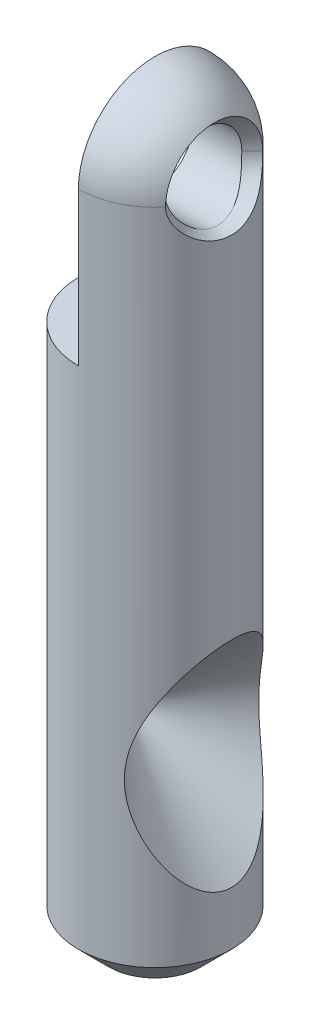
ISO-10303-21;
HEADER;
FILE_DESCRIPTION(('STEP AP214'),'2;1');
FILE_NAME('part.step','',(''),(''),'','','');
FILE_SCHEMA(('AUTOMOTIVE_DESIGN { 1 0 10303 214 1 1 1 1 }'));
ENDSEC;
DATA;
#1=APPLICATION_CONTEXT('core data for automotive mechanical design processes');
#2=APPLICATION_PROTOCOL_DEFINITION('international standard','automotive_design',2000,#1);
#3=PRODUCT_CONTEXT('',#1,'mechanical');
#4=PRODUCT('Part','Part','',(#3));
#5=PRODUCT_RELATED_PRODUCT_CATEGORY('part','',(#4));
#6=PRODUCT_DEFINITION_FORMATION('','',#4);
#7=PRODUCT_DEFINITION_CONTEXT('part definition',#1,'design');
#8=PRODUCT_DEFINITION('design','',#6,#7);
#9=PRODUCT_DEFINITION_SHAPE('','',#8);
#10=(LENGTH_UNIT() NAMED_UNIT(*) SI_UNIT(.MILLI.,.METRE.));
#11=(NAMED_UNIT(*) PLANE_ANGLE_UNIT() SI_UNIT($,.RADIAN.));
#12=(NAMED_UNIT(*) SI_UNIT($,.STERADIAN.) SOLID_ANGLE_UNIT());
#13=UNCERTAINTY_MEASURE_WITH_UNIT(LENGTH_MEASURE(1.E-05),#10,'distance_accuracy_value','');
#14=(GEOMETRIC_REPRESENTATION_CONTEXT(3) GLOBAL_UNCERTAINTY_ASSIGNED_CONTEXT((#13)) GLOBAL_UNIT_ASSIGNED_CONTEXT((#10,
#11,#12)) REPRESENTATION_CONTEXT('',''));
#15=CARTESIAN_POINT('',(0.,0.,0.));
#16=DIRECTION('',(0.,0.,1.));
#17=DIRECTION('',(1.,0.,0.));
#18=AXIS2_PLACEMENT_3D('',#15,#16,#17);
#19=CARTESIAN_POINT('',(-2.00000000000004,12.5,-14.3835569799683));
#20=DIRECTION('',(1.,0.,0.));
#21=DIRECTION('',(0.,0.,-1.));
#22=AXIS2_PLACEMENT_3D('',#19,#20,#21);
#23=PLANE('',#22);
#24=CARTESIAN_POINT('',(-2.,12.5,0.));
#25=DIRECTION('',(-1.,0.,0.));
#26=DIRECTION('',(0.,0.,1.));
#27=AXIS2_PLACEMENT_3D('',#24,#25,#26);
#28=CIRCLE('',#27,0.05);
#29=CARTESIAN_POINT('',(-2.,12.5,0.05));
#30=VERTEX_POINT('',#29);
#31=EDGE_CURVE('E34',#30,#30,#28,.F.);
#32=ORIENTED_EDGE('',*,*,#31,.T.);
#33=EDGE_LOOP('',(#32));
#34=FACE_BOUND('',#33,.T.);
#35=ADVANCED_FACE('F16',(#34),#23,.T.);
#36=CARTESIAN_POINT('',(0.,0.,0.));
#37=DIRECTION('',(0.,-1.,0.));
#38=DIRECTION('',(0.,0.,-1.));
#39=AXIS2_PLACEMENT_3D('',#36,#37,#38);
#40=PLANE('',#39);
#41=CARTESIAN_POINT('',(0.,-9.09494701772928E-10,0.));
#42=DIRECTION('',(0.,1.,0.));
#43=DIRECTION('',(0.,0.,1.));
#44=AXIS2_PLACEMENT_3D('',#41,#42,#43);
#45=CIRCLE('',#44,3.0000000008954);
#46=CARTESIAN_POINT('',(0.,-9.09494701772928E-10,3.0000000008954));
#47=VERTEX_POINT('',#46);
#48=EDGE_CURVE('E81',#47,#47,#45,.T.);
#49=ORIENTED_EDGE('',*,*,#48,.F.);
#50=EDGE_LOOP('',(#49));
#51=FACE_BOUND('',#50,.T.);
#52=ADVANCED_FACE('F119',(#51),#40,.T.);
#53=CARTESIAN_POINT('',(0.,45.,0.));
#54=DIRECTION('',(1.,0.,0.));
#55=DIRECTION('',(0.,0.,-1.));
#56=AXIS2_PLACEMENT_3D('',#53,#54,#55);
#57=CYLINDRICAL_SURFACE('',#56,2.5);
#58=CARTESIAN_POINT('',(3.169751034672,44.9999999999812,2.5));
#59=CARTESIAN_POINT('',(3.16977038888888,45.0703136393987,2.50000684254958));
#60=CARTESIAN_POINT('',(3.16981172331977,45.1406242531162,2.49703366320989));
#61=CARTESIAN_POINT('',(3.1698800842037,45.2807424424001,2.48517971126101));
#62=CARTESIAN_POINT('',(3.16990711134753,45.3505500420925,2.47629922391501));
#63=CARTESIAN_POINT('',(3.16988860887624,45.4891234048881,2.45269139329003));
#64=CARTESIAN_POINT('',(3.16984313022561,45.5578898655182,2.43796816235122));
#65=CARTESIAN_POINT('',(3.16975675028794,45.6939225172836,2.40279270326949));
#66=CARTESIAN_POINT('',(3.16971584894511,45.7611887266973,2.38234054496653));
#67=CARTESIAN_POINT('',(3.1696792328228,45.9600784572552,2.3125650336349));
#68=CARTESIAN_POINT('',(3.16976950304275,46.0888499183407,2.25481290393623));
#69=CARTESIAN_POINT('',(3.16985124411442,46.3348245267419,2.11849273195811));
#70=CARTESIAN_POINT('',(3.16984273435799,46.4520299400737,2.03992877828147));
#71=CARTESIAN_POINT('',(3.16981003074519,46.616619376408,1.90827131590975));
#72=CARTESIAN_POINT('',(3.16979579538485,46.6696342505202,1.8620594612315));
#73=CARTESIAN_POINT('',(3.16975812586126,46.7715975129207,1.76532581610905));
#74=CARTESIAN_POINT('',(3.16973469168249,46.8205458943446,1.71480401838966));
#75=CARTESIAN_POINT('',(3.16971424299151,46.9140178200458,1.60980631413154));
#76=CARTESIAN_POINT('',(3.16971723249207,46.958540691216,1.55532980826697));
#77=CARTESIAN_POINT('',(3.16977986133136,47.0428329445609,1.44283780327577));
#78=CARTESIAN_POINT('',(3.16983950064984,47.0826023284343,1.38482230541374));
#79=CARTESIAN_POINT('',(3.16995324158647,47.1943342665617,1.20606473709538));
#80=CARTESIAN_POINT('',(3.16994239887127,47.2588088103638,1.08051233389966));
#81=CARTESIAN_POINT('',(3.1696971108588,47.3657234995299,0.820461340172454));
#82=CARTESIAN_POINT('',(3.16946267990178,47.4081650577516,0.685963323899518));
#83=CARTESIAN_POINT('',(3.16945032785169,47.4698709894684,0.411654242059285));
#84=CARTESIAN_POINT('',(3.16967241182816,47.4891351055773,0.271843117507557));
#85=CARTESIAN_POINT('',(3.16985907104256,47.5002403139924,0.0613449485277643));
#86=CARTESIAN_POINT('',(3.16989686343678,47.5009731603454,-0.00898359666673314));
#87=CARTESIAN_POINT('',(3.16991398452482,47.4965153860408,-0.149472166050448));
#88=CARTESIAN_POINT('',(3.16989331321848,47.4913247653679,-0.219632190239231));
#89=CARTESIAN_POINT('',(3.1698146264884,47.4750506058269,-0.359259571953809));
#90=CARTESIAN_POINT('',(3.16975661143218,47.4639671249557,-0.428726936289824));
#91=CARTESIAN_POINT('',(3.16970089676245,47.4359877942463,-0.566482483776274));
#92=CARTESIAN_POINT('',(3.16970319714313,47.4190919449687,-0.634770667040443));
#93=CARTESIAN_POINT('',(3.16974474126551,47.3796075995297,-0.769680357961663));
#94=CARTESIAN_POINT('',(3.16978398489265,47.3570191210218,-0.836301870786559));
#95=CARTESIAN_POINT('',(3.16983428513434,47.3063102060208,-0.967405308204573));
#96=CARTESIAN_POINT('',(3.16984534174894,47.2781897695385,-1.03188723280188));
#97=CARTESIAN_POINT('',(3.16983822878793,47.2166157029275,-1.15825517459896));
#98=CARTESIAN_POINT('',(3.16982005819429,47.1831618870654,-1.22014110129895));
#99=CARTESIAN_POINT('',(3.16980266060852,47.1111597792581,-1.34087460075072));
#100=CARTESIAN_POINT('',(3.16980343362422,47.0726114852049,-1.39972217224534));
#101=CARTESIAN_POINT('',(3.16980749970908,46.9906958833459,-1.5139581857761));
#102=CARTESIAN_POINT('',(3.16981079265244,46.9473288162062,-1.56934680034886));
#103=CARTESIAN_POINT('',(3.16980132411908,46.8560848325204,-1.67627249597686));
#104=CARTESIAN_POINT('',(3.16978856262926,46.8082079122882,-1.72780957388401));
#105=CARTESIAN_POINT('',(3.16979308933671,46.7082821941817,-1.82666610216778));
#106=CARTESIAN_POINT('',(3.16981037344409,46.6562339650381,-1.87398612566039));
#107=CARTESIAN_POINT('',(3.16981863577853,46.575326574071,-1.94154112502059));
#108=CARTESIAN_POINT('',(3.1698184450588,46.5478821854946,-1.96349054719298));
#109=CARTESIAN_POINT('',(3.16978879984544,46.4920908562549,-2.00621522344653));
#110=CARTESIAN_POINT('',(3.16975934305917,46.4637438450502,-2.0269903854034));
#111=CARTESIAN_POINT('',(3.16972219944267,46.3774113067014,-2.08750476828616));
#112=CARTESIAN_POINT('',(3.16976575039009,46.3181379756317,-2.12542979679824));
#113=CARTESIAN_POINT('',(3.16978217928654,46.1966187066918,-2.19614385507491));
#114=CARTESIAN_POINT('',(3.16975505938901,46.1343728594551,-2.22893304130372));
#115=CARTESIAN_POINT('',(3.16975485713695,46.0073041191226,-2.28916608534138));
#116=CARTESIAN_POINT('',(3.16978179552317,45.9424802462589,-2.31660788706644));
#117=CARTESIAN_POINT('',(3.16976260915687,45.8436905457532,-2.3535982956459));
#118=CARTESIAN_POINT('',(3.16974626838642,45.8104921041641,-2.36523573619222));
#119=CARTESIAN_POINT('',(3.16973817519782,45.7436223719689,-2.387103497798));
#120=CARTESIAN_POINT('',(3.16974642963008,45.7099509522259,-2.39733342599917));
#121=CARTESIAN_POINT('',(3.16977236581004,45.6422706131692,-2.4163446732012));
#122=CARTESIAN_POINT('',(3.16979002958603,45.6082624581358,-2.42512871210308));
#123=CARTESIAN_POINT('',(3.16978373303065,45.5399056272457,-2.44125701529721));
#124=CARTESIAN_POINT('',(3.16975976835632,45.5055569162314,-2.44860112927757));
#125=CARTESIAN_POINT('',(3.16972465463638,45.4021029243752,-2.46844899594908));
#126=CARTESIAN_POINT('',(3.16975023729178,45.332562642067,-2.4787758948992));
#127=CARTESIAN_POINT('',(3.16975823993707,45.2190624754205,-2.49077132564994));
#128=CARTESIAN_POINT('',(3.16975324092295,45.17528080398,-2.49423424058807));
#129=CARTESIAN_POINT('',(3.16974568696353,45.087668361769,-2.49884674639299));
#130=CARTESIAN_POINT('',(3.1697431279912,45.0438377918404,-2.50000015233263));
#131=CARTESIAN_POINT('',(3.16975103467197,45.,-2.5));
#132=B_SPLINE_CURVE_WITH_KNOTS('',3,(#58,#59,#60,#61,#62,#63,#64,#65,#66,#67,#68,#69,#70,#71,
#72,#73,#74,#75,#76,#77,#78,#79,#80,#81,#82,#83,#84,#85,#86,#87,#88,#89,#90,#91,#92,#93,#94,#95,
#96,#97,#98,#99,#100,#101,#102,#103,#104,#105,#106,#107,#108,#109,#110,#111,#112,#113,#114,#115,
#116,#117,#118,#119,#120,#121,#122,#123,#124,#125,#126,#127,#128,#129,#130,#131),.UNSPECIFIED.,
.F.,.F.,(4,2,2,2,2,2,2,2,2,2,2,2,2,2,2,2,2,2,2,2,2,2,2,2,2,2,2,2,2,2,2,2,2,2,2,2,4),(0.,
0.210872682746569,0.421735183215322,0.632449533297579,0.843161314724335,1.26441408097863,
1.68558415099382,1.89636058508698,2.10713737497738,2.31794617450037,2.52875489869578,
2.94997900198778,3.37117609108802,3.79237785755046,4.00317103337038,4.21396420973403,
4.4247553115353,4.6355463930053,4.84633682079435,5.05712724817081,5.26792501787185,
5.47872287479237,5.68951020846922,5.90029771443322,6.1110565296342,6.21645602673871,
6.32186378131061,6.53269370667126,6.74351720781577,6.95442161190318,7.05993320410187,
7.16547418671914,7.27081430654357,7.37616541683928,7.58678331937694,7.71848486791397,
7.84996867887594),.UNSPECIFIED.);
#133=CARTESIAN_POINT('',(3.16975103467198,44.9999999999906,2.5));
#134=VERTEX_POINT('',#133);
#135=CARTESIAN_POINT('',(3.16975103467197,45.,-2.5));
#136=VERTEX_POINT('',#135);
#137=EDGE_CURVE('E19',#134,#136,#132,.T.);
#138=ORIENTED_EDGE('',*,*,#137,.F.);
#139=CARTESIAN_POINT('',(3.16975103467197,45.,-2.5));
#140=CARTESIAN_POINT('',(3.16974905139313,44.9862423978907,-2.50000002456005));
#141=CARTESIAN_POINT('',(3.169831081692,44.9724848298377,-2.49988643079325));
#142=CARTESIAN_POINT('',(3.17018514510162,44.9449760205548,-2.49943225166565));
#143=CARTESIAN_POINT('',(3.17045717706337,44.9312247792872,-2.49909166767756));
#144=CARTESIAN_POINT('',(3.17159095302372,44.8900001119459,-2.49773014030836));
#145=CARTESIAN_POINT('',(3.17277034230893,44.8625452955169,-2.49636942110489));
#146=CARTESIAN_POINT('',(3.17590602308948,44.8077631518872,-2.4927490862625));
#147=CARTESIAN_POINT('',(3.17786169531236,44.7804357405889,-2.49049018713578));
#148=CARTESIAN_POINT('',(3.18246961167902,44.725928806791,-2.4850825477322));
#149=CARTESIAN_POINT('',(3.18512187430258,44.6987492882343,-2.48193378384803));
#150=CARTESIAN_POINT('',(3.19412582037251,44.6179163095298,-2.47122438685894));
#151=CARTESIAN_POINT('',(3.20154880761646,44.5645444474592,-2.46237229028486));
#152=CARTESIAN_POINT('',(3.21901152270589,44.4588915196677,-2.44133270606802));
#153=CARTESIAN_POINT('',(3.22905200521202,44.4066107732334,-2.42914425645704));
#154=CARTESIAN_POINT('',(3.24713997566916,44.3229333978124,-2.40679933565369));
#155=CARTESIAN_POINT('',(3.25450342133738,44.2911218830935,-2.39761986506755));
#156=CARTESIAN_POINT('',(3.27006511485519,44.2280712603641,-2.37806972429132));
#157=CARTESIAN_POINT('',(3.27826340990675,44.196832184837,-2.36769898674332));
#158=CARTESIAN_POINT('',(3.29535569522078,44.1349514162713,-2.34579802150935));
#159=CARTESIAN_POINT('',(3.304249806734,44.1043098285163,-2.33426759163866));
#160=CARTESIAN_POINT('',(3.32264311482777,44.0436614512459,-2.31008269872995));
#161=CARTESIAN_POINT('',(3.33214229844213,44.0136546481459,-2.29742825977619));
#162=CARTESIAN_POINT('',(3.36156986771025,43.9244724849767,-2.25776091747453));
#163=CARTESIAN_POINT('',(3.38238020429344,43.8663082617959,-2.22910542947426));
#164=CARTESIAN_POINT('',(3.42545519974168,43.7528053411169,-2.16764109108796));
#165=CARTESIAN_POINT('',(3.44771979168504,43.6974665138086,-2.13483243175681));
#166=CARTESIAN_POINT('',(3.4936798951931,43.5890550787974,-2.06481467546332));
#167=CARTESIAN_POINT('',(3.5173908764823,43.5360241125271,-2.02755125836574));
#168=CARTESIAN_POINT('',(3.56517975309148,43.4331177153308,-1.94911804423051));
#169=CARTESIAN_POINT('',(3.58925764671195,43.3832422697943,-1.90794826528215));
#170=CARTESIAN_POINT('',(3.63746350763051,43.286836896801,-1.82188111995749));
#171=CARTESIAN_POINT('',(3.66159147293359,43.2403068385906,-1.7769838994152));
#172=CARTESIAN_POINT('',(3.6972791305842,43.1731100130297,-1.70690342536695));
#173=CARTESIAN_POINT('',(3.70909238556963,43.1511415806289,-1.68308440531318));
#174=CARTESIAN_POINT('',(3.73256067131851,43.1081105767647,-1.63456620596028));
#175=CARTESIAN_POINT('',(3.74421569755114,43.0870480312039,-1.6098670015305));
#176=CARTESIAN_POINT('',(3.78240673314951,43.018802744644,-1.52659913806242));
#177=CARTESIAN_POINT('',(3.80840030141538,42.9736135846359,-1.4661174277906));
#178=CARTESIAN_POINT('',(3.8582502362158,42.8885370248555,-1.34069614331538));
#179=CARTESIAN_POINT('',(3.88210629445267,42.8486503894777,-1.27575592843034));
#180=CARTESIAN_POINT('',(3.92708045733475,42.7746764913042,-1.1418322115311));
#181=CARTESIAN_POINT('',(3.94820127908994,42.7405834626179,-1.07285282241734));
#182=CARTESIAN_POINT('',(3.98706027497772,42.6786309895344,-0.931243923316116));
#183=CARTESIAN_POINT('',(4.00479948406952,42.650769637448,-0.858615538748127));
#184=CARTESIAN_POINT('',(4.03294869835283,42.6067480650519,-0.72540350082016));
#185=CARTESIAN_POINT('',(4.04411562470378,42.589360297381,-0.665384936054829));
#186=CARTESIAN_POINT('',(4.05887073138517,42.5666364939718,-0.574216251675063));
#187=CARTESIAN_POINT('',(4.06345669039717,42.5596213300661,-0.543635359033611));
#188=CARTESIAN_POINT('',(4.07192750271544,42.54673067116,-0.482137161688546));
#189=CARTESIAN_POINT('',(4.07581239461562,42.5408551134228,-0.451219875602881));
#190=CARTESIAN_POINT('',(4.08275293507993,42.5302676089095,-0.389118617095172));
#191=CARTESIAN_POINT('',(4.08580921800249,42.5255547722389,-0.357934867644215));
#192=CARTESIAN_POINT('',(4.0910869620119,42.5173058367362,-0.29534076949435));
#193=CARTESIAN_POINT('',(4.09330837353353,42.5137698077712,-0.263930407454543));
#194=CARTESIAN_POINT('',(4.09708729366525,42.5078891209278,-0.200956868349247));
#195=CARTESIAN_POINT('',(4.0986447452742,42.5055445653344,-0.169393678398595));
#196=CARTESIAN_POINT('',(4.10111795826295,42.5020550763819,-0.106176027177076));
#197=CARTESIAN_POINT('',(4.10203373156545,42.5009101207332,-0.0745215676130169));
#198=CARTESIAN_POINT('',(4.10308389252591,42.4998230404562,-0.0111001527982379));
#199=CARTESIAN_POINT('',(4.10321636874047,42.4998838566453,0.0206668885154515));
#200=CARTESIAN_POINT('',(4.10262355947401,42.5012152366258,0.0841649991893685));
#201=CARTESIAN_POINT('',(4.10189829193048,42.5024857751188,0.115896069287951));
#202=CARTESIAN_POINT('',(4.0983649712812,42.5081060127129,0.210918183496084));
#203=CARTESIAN_POINT('',(4.09419994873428,42.514263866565,0.274065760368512));
#204=CARTESIAN_POINT('',(4.08252259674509,42.5313003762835,0.399407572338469));
#205=CARTESIAN_POINT('',(4.07500951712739,42.5421800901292,0.461601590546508));
#206=CARTESIAN_POINT('',(4.06181684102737,42.5619229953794,0.553868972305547));
#207=CARTESIAN_POINT('',(4.05709759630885,42.5690763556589,0.584460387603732));
#208=CARTESIAN_POINT('',(4.04705451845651,42.5845032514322,0.64525883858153));
#209=CARTESIAN_POINT('',(4.04173070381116,42.5927767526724,0.675465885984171));
#210=CARTESIAN_POINT('',(4.02552900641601,42.6180757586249,0.761475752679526));
#211=CARTESIAN_POINT('',(4.01384171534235,42.6364638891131,0.81673383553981));
#212=CARTESIAN_POINT('',(3.98829341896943,42.6768463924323,0.925373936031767));
#213=CARTESIAN_POINT('',(3.97443286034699,42.6988400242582,0.978756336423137));
#214=CARTESIAN_POINT('',(3.94481719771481,42.7462301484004,1.08343043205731));
#215=CARTESIAN_POINT('',(3.92906238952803,42.7716261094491,1.13472245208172));
#216=CARTESIAN_POINT('',(3.89600259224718,42.8256364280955,1.23506716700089));
#217=CARTESIAN_POINT('',(3.87869735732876,42.854251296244,1.28411950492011));
#218=CARTESIAN_POINT('',(3.84050731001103,42.9184634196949,1.38610773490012));
#219=CARTESIAN_POINT('',(3.81945032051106,42.9544844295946,1.43871273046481));
#220=CARTESIAN_POINT('',(3.77603540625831,43.0301429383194,1.54068026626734));
#221=CARTESIAN_POINT('',(3.7536774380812,43.0697805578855,1.59004269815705));
#222=CARTESIAN_POINT('',(3.70810867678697,43.1525248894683,1.68547617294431));
#223=CARTESIAN_POINT('',(3.6848967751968,43.1956362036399,1.73154269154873));
#224=CARTESIAN_POINT('',(3.63817913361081,43.2851318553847,1.82021835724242));
#225=CARTESIAN_POINT('',(3.61467337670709,43.3315163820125,1.86282730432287));
#226=CARTESIAN_POINT('',(3.56407634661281,43.4349161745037,1.95085062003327));
#227=CARTESIAN_POINT('',(3.5370006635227,43.4924580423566,1.99565761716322));
#228=CARTESIAN_POINT('',(3.48371711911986,43.611521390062,2.08025514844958));
#229=CARTESIAN_POINT('',(3.45750945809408,43.6730437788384,2.12004453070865));
#230=CARTESIAN_POINT('',(3.40682454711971,43.7998308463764,2.19430795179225));
#231=CARTESIAN_POINT('',(3.38234599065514,43.865092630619,2.22878602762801));
#232=CARTESIAN_POINT('',(3.33602652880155,43.9991687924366,2.29212325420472));
#233=CARTESIAN_POINT('',(3.31418438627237,44.0679814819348,2.32098504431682));
#234=CARTESIAN_POINT('',(3.27934680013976,44.1907959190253,2.36607309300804));
#235=CARTESIAN_POINT('',(3.26551898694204,44.2440713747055,2.38364169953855));
#236=CARTESIAN_POINT('',(3.24029506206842,44.3522108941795,2.41527239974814));
#237=CARTESIAN_POINT('',(3.2288983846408,44.4070745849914,2.42933530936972));
#238=CARTESIAN_POINT('',(3.2088399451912,44.5179636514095,2.45374335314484));
#239=CARTESIAN_POINT('',(3.2001711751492,44.5739856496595,2.46409802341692));
#240=CARTESIAN_POINT('',(3.1859457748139,44.6869727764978,2.48098211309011));
#241=CARTESIAN_POINT('',(3.18038725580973,44.7439373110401,2.48751385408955));
#242=CARTESIAN_POINT('',(3.17426035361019,44.834185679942,2.49471529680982));
#243=CARTESIAN_POINT('',(3.17257576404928,44.8672973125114,2.49669587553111));
#244=CARTESIAN_POINT('',(3.1703245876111,44.9336044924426,2.49933854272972));
#245=CARTESIAN_POINT('',(3.16975778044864,44.9668000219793,2.50000089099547));
#246=CARTESIAN_POINT('',(3.16975103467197,45.,2.5));
#247=B_SPLINE_CURVE_WITH_KNOTS('',3,(#139,#140,#141,#142,#143,#144,#145,#146,#147,#148,#149,
#150,#151,#152,#153,#154,#155,#156,#157,#158,#159,#160,#161,#162,#163,#164,#165,#166,#167,#168,
#169,#170,#171,#172,#173,#174,#175,#176,#177,#178,#179,#180,#181,#182,#183,#184,#185,#186,#187,
#188,#189,#190,#191,#192,#193,#194,#195,#196,#197,#198,#199,#200,#201,#202,#203,#204,#205,#206,
#207,#208,#209,#210,#211,#212,#213,#214,#215,#216,#217,#218,#219,#220,#221,#222,#223,#224,#225,
#226,#227,#228,#229,#230,#231,#232,#233,#234,#235,#236,#237,#238,#239,#240,#241,#242,#243,#244,
#245,#246),.UNSPECIFIED.,.F.,.F.,(4,2,2,2,2,2,2,2,2,2,2,2,2,2,2,2,2,2,2,2,2,2,2,2,2,2,2,2,2,2,2,
2,2,2,2,2,2,2,2,2,2,2,2,2,2,2,2,2,2,2,2,2,2,4),(0.,0.0412718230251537,0.0825433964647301,
0.165055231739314,0.24750137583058,0.329949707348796,0.493573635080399,0.657244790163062,
0.758967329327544,0.860695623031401,0.962441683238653,1.06418556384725,1.26824053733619,
1.47228612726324,1.67913833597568,1.8859895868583,2.09283274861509,2.1962796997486,
2.29972960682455,2.53893201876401,2.77816887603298,3.01716622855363,3.2560903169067,
3.44627781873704,3.54137884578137,3.63647463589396,3.73149741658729,3.82652583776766,
3.92156241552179,4.01659722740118,4.11186385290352,4.20712848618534,4.39757517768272,
4.58806456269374,4.68334872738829,4.77862997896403,4.95662654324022,5.13458657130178,
5.31251884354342,5.49047937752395,5.69171011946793,5.89294758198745,6.09445618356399,
6.2959764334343,6.52908871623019,6.76225441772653,6.99524201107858,7.22811984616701,
7.40128774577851,7.57441530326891,7.747094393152,7.9196685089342,8.0192682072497,
8.11884827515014),.UNSPECIFIED.);
#248=EDGE_CURVE('E72',#136,#134,#247,.T.);
#249=ORIENTED_EDGE('',*,*,#248,.F.);
#250=EDGE_LOOP('',(#138,#249));
#251=FACE_BOUND('',#250,.T.);
#252=CARTESIAN_POINT('',(0.,45.,0.));
#253=DIRECTION('',(1.,0.,0.));
#254=DIRECTION('',(0.,0.,-1.));
#255=AXIS2_PLACEMENT_3D('',#252,#253,#254);
#256=CIRCLE('',#255,2.5);
#257=CARTESIAN_POINT('',(0.,45.,-2.5));
#258=VERTEX_POINT('',#257);
#259=EDGE_CURVE('E133',#258,#258,#256,.F.);
#260=ORIENTED_EDGE('',*,*,#259,.T.);
#261=EDGE_LOOP('',(#260));
#262=FACE_BOUND('',#261,.T.);
#263=ADVANCED_FACE('F73',(#251,#262),#57,.F.);
#264=CARTESIAN_POINT('',(3.87025707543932,44.9999999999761,3.18081509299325));
#265=CARTESIAN_POINT('',(3.87025707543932,45.2436396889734,3.18081509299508));
#266=CARTESIAN_POINT('',(3.87025707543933,45.7299847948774,3.1237387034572));
#267=CARTESIAN_POINT('',(3.87025707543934,46.4055460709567,2.8831857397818));
#268=CARTESIAN_POINT('',(3.87025707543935,47.0123343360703,2.4977613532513));
#269=CARTESIAN_POINT('',(3.87025707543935,47.6874770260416,1.81634727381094));
#270=CARTESIAN_POINT('',(3.87025707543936,48.2120151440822,0.713673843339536));
#271=CARTESIAN_POINT('',(3.87025707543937,48.2038317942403,-0.507895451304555));
#272=CARTESIAN_POINT('',(3.87025707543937,47.920885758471,-1.297835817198));
#273=CARTESIAN_POINT('',(3.87025707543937,47.6875070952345,-1.71385456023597));
#274=CARTESIAN_POINT('',(3.87025707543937,47.4783958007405,-2.00429163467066));
#275=CARTESIAN_POINT('',(3.87025707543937,47.2382559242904,-2.26941186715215));
#276=CARTESIAN_POINT('',(3.87025707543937,46.9690786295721,-2.50660310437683));
#277=CARTESIAN_POINT('',(3.87025707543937,46.6649390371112,-2.71943418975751));
#278=CARTESIAN_POINT('',(3.87025707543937,46.3695206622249,-2.87663522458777));
#279=CARTESIAN_POINT('',(3.87025707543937,46.1165814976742,-2.98067041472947));
#280=CARTESIAN_POINT('',(3.87025707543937,45.8607869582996,-3.06737297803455));
#281=CARTESIAN_POINT('',(3.87025707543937,45.605926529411,-3.12672427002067));
#282=CARTESIAN_POINT('',(3.87025707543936,45.3768720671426,-3.1597164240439));
#283=CARTESIAN_POINT('',(3.87025707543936,45.2348847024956,-3.17296915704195));
#284=CARTESIAN_POINT('',(3.87025707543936,45.117106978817,-3.17931866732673));
#285=CARTESIAN_POINT('',(3.87025707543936,45.0399891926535,-3.1808150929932));
#286=CARTESIAN_POINT('',(3.87025707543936,45.,-3.1808150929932));
#287=CARTESIAN_POINT('',(3.86794517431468,44.9999999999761,3.17856817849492));
#288=CARTESIAN_POINT('',(3.86794517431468,45.2434675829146,3.17856817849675));
#289=CARTESIAN_POINT('',(3.86794517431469,45.7294691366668,3.12153210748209));
#290=CARTESIAN_POINT('',(3.8679451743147,46.4045531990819,2.88114906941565));
#291=CARTESIAN_POINT('',(3.8679451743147,47.0109128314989,2.49599694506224));
#292=CARTESIAN_POINT('',(3.86794517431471,47.6855786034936,1.81506421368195));
#293=CARTESIAN_POINT('',(3.86794517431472,48.2097461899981,0.713169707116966));
#294=CARTESIAN_POINT('',(3.86794517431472,48.2015686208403,-0.507536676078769));
#295=CARTESIAN_POINT('',(3.86794517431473,47.918822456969,-1.2969190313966));
#296=CARTESIAN_POINT('',(3.86794517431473,47.6856086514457,-1.71264390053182));
#297=CARTESIAN_POINT('',(3.86794517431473,47.4766450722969,-2.00287581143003));
#298=CARTESIAN_POINT('',(3.86794517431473,47.2366748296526,-2.26780876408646));
#299=CARTESIAN_POINT('',(3.86794517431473,46.9676876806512,-2.50483245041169));
#300=CARTESIAN_POINT('',(3.86794517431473,46.6637629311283,-2.71751319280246));
#301=CARTESIAN_POINT('',(3.86794517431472,46.3685532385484,-2.87460318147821));
#302=CARTESIAN_POINT('',(3.86794517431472,46.1157927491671,-2.97856488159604));
#303=CARTESIAN_POINT('',(3.86794517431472,45.8601789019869,-3.06520619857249));
#304=CARTESIAN_POINT('',(3.86794517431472,45.605498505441,-3.1245155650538));
#305=CARTESIAN_POINT('',(3.86794517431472,45.3766058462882,-3.1574844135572));
#306=CARTESIAN_POINT('',(3.86794517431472,45.2347187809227,-3.17072778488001));
#307=CARTESIAN_POINT('',(3.86794517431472,45.1170242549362,-3.17707280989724));
#308=CARTESIAN_POINT('',(3.86794517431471,45.0399609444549,-3.17856817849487));
#309=CARTESIAN_POINT('',(3.86794517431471,45.,-3.17856817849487));
#310=CARTESIAN_POINT('',(3.86563327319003,44.9999999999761,3.17632126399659));
#311=CARTESIAN_POINT('',(3.86563327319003,45.2432954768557,3.17632126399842));
#312=CARTESIAN_POINT('',(3.86563327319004,45.7289534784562,3.11932551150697));
#313=CARTESIAN_POINT('',(3.86563327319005,46.403560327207,2.8791123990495));
#314=CARTESIAN_POINT('',(3.86563327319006,47.0094913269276,2.49423253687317));
#315=CARTESIAN_POINT('',(3.86563327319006,47.6836801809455,1.81378115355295));
#316=CARTESIAN_POINT('',(3.86563327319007,48.2074772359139,0.712665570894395));
#317=CARTESIAN_POINT('',(3.86563327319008,48.1993054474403,-0.507177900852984));
#318=CARTESIAN_POINT('',(3.86563327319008,47.9167591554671,-1.29600224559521));
#319=CARTESIAN_POINT('',(3.86563327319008,47.6837102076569,-1.71143324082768));
#320=CARTESIAN_POINT('',(3.86563327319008,47.4748943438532,-2.00145998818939));
#321=CARTESIAN_POINT('',(3.86563327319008,47.2350937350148,-2.26620566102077));
#322=CARTESIAN_POINT('',(3.86563327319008,46.9662967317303,-2.50306179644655));
#323=CARTESIAN_POINT('',(3.86563327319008,46.6625868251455,-2.71559219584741));
#324=CARTESIAN_POINT('',(3.86563327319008,46.3675858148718,-2.87257113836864));
#325=CARTESIAN_POINT('',(3.86563327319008,46.1150040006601,-2.97645934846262));
#326=CARTESIAN_POINT('',(3.86563327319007,45.8595708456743,-3.06303941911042));
#327=CARTESIAN_POINT('',(3.86563327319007,45.605070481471,-3.12230686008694));
#328=CARTESIAN_POINT('',(3.86563327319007,45.3763396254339,-3.15525240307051));
#329=CARTESIAN_POINT('',(3.86563327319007,45.2345528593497,-3.16848641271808));
#330=CARTESIAN_POINT('',(3.86563327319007,45.1169415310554,-3.17482695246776));
#331=CARTESIAN_POINT('',(3.86563327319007,45.0399326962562,-3.17632126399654));
#332=CARTESIAN_POINT('',(3.86563327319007,45.,-3.17632126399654));
#333=CARTESIAN_POINT('',(3.86332137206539,44.9999999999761,3.17407434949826));
#334=CARTESIAN_POINT('',(3.86332137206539,45.2431233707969,3.17407434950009));
#335=CARTESIAN_POINT('',(3.8633213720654,45.7284378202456,3.11711891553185));
#336=CARTESIAN_POINT('',(3.86332137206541,46.4025674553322,2.87707572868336));
#337=CARTESIAN_POINT('',(3.86332137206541,47.0080698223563,2.4924681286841));
#338=CARTESIAN_POINT('',(3.86332137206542,47.6817817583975,1.81249809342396));
#339=CARTESIAN_POINT('',(3.86332137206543,48.2052082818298,0.712161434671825));
#340=CARTESIAN_POINT('',(3.86332137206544,48.1970422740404,-0.506819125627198));
#341=CARTESIAN_POINT('',(3.86332137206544,47.9146958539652,-1.29508545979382));
#342=CARTESIAN_POINT('',(3.86332137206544,47.6818117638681,-1.71022258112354));
#343=CARTESIAN_POINT('',(3.86332137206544,47.4731436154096,-2.00004416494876));
#344=CARTESIAN_POINT('',(3.86332137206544,47.2335126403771,-2.26460255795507));
#345=CARTESIAN_POINT('',(3.86332137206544,46.9649057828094,-2.50129114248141));
#346=CARTESIAN_POINT('',(3.86332137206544,46.6614107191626,-2.71367119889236));
#347=CARTESIAN_POINT('',(3.86332137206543,46.3666183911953,-2.87053909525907));
#348=CARTESIAN_POINT('',(3.86332137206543,46.1142152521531,-2.9743538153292));
#349=CARTESIAN_POINT('',(3.86332137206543,45.8589627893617,-3.06087263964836));
#350=CARTESIAN_POINT('',(3.86332137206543,45.604642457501,-3.12009815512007));
#351=CARTESIAN_POINT('',(3.86332137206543,45.3760734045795,-3.15302039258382));
#352=CARTESIAN_POINT('',(3.86332137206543,45.2343869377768,-3.16624504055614));
#353=CARTESIAN_POINT('',(3.86332137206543,45.1168588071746,-3.17258109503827));
#354=CARTESIAN_POINT('',(3.86332137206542,45.0399044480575,-3.17407434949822));
#355=CARTESIAN_POINT('',(3.86332137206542,45.,-3.17407434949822));
#356=CARTESIAN_POINT('',(3.63213125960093,44.9999999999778,2.94938289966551));
#357=CARTESIAN_POINT('',(3.63213125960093,45.2259127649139,2.94938289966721));
#358=CARTESIAN_POINT('',(3.63213125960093,45.6768719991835,2.89645931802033));
#359=CARTESIAN_POINT('',(3.63213125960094,46.3032802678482,2.67340869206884));
#360=CARTESIAN_POINT('',(3.63213125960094,46.8659193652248,2.31602730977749));
#361=CARTESIAN_POINT('',(3.63213125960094,47.4919395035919,1.68419208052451));
#362=CARTESIAN_POINT('',(3.63213125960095,47.9783128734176,0.661747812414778));
#363=CARTESIAN_POINT('',(3.63213125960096,47.9707249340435,-0.470941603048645));
#364=CARTESIAN_POINT('',(3.63213125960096,47.7083657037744,-1.20340687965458));
#365=CARTESIAN_POINT('',(3.63213125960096,47.4919673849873,-1.58915661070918));
#366=CARTESIAN_POINT('',(3.63213125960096,47.2980707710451,-1.8584618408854));
#367=CARTESIAN_POINT('',(3.63213125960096,47.0754031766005,-2.10429225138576));
#368=CARTESIAN_POINT('',(3.63213125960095,46.825810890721,-2.32422574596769));
#369=CARTESIAN_POINT('',(3.63213125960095,46.5438001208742,-2.52157150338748));
#370=CARTESIAN_POINT('',(3.63213125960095,46.2698760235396,-2.66733478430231));
#371=CARTESIAN_POINT('',(3.63213125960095,46.0353404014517,-2.76380050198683));
#372=CARTESIAN_POINT('',(3.63213125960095,45.7981571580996,-2.84419469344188));
#373=CARTESIAN_POINT('',(3.63213125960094,45.5618400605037,-2.89922765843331));
#374=CARTESIAN_POINT('',(3.63213125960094,45.3494513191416,-2.92981934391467));
#375=CARTESIAN_POINT('',(3.63213125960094,45.2177947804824,-2.94210782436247));
#376=CARTESIAN_POINT('',(3.63213125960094,45.1085864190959,-2.94799535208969));
#377=CARTESIAN_POINT('',(3.63213125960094,45.0370796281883,-2.94938289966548));
#378=CARTESIAN_POINT('',(3.63213125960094,45.,-2.94938289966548));
#379=CARTESIAN_POINT('',(3.40094114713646,44.9999999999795,2.72469144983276));
#380=CARTESIAN_POINT('',(3.40094114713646,45.2087021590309,2.72469144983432));
#381=CARTESIAN_POINT('',(3.40094114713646,45.6253061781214,2.6757997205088));
#382=CARTESIAN_POINT('',(3.40094114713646,46.2039930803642,2.46974165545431));
#383=CARTESIAN_POINT('',(3.40094114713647,46.7237689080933,2.13958649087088));
#384=CARTESIAN_POINT('',(3.40094114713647,47.3020972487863,1.55588606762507));
#385=CARTESIAN_POINT('',(3.40094114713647,47.7514174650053,0.611334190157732));
#386=CARTESIAN_POINT('',(3.40094114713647,47.7444075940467,-0.43506408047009));
#387=CARTESIAN_POINT('',(3.40094114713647,47.5020355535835,-1.11172829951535));
#388=CARTESIAN_POINT('',(3.40094114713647,47.3021230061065,-1.46809064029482));
#389=CARTESIAN_POINT('',(3.40094114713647,47.1229979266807,-1.71687951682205));
#390=CARTESIAN_POINT('',(3.40094114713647,46.917293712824,-1.94398194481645));
#391=CARTESIAN_POINT('',(3.40094114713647,46.6867159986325,-2.14716034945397));
#392=CARTESIAN_POINT('',(3.40094114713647,46.4261895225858,-2.32947180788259));
#393=CARTESIAN_POINT('',(3.40094114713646,46.1731336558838,-2.46413047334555));
#394=CARTESIAN_POINT('',(3.40094114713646,45.9564655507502,-2.55324718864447));
#395=CARTESIAN_POINT('',(3.40094114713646,45.7373515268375,-2.62751674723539));
#396=CARTESIAN_POINT('',(3.40094114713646,45.5190376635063,-2.67835716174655));
#397=CARTESIAN_POINT('',(3.40094114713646,45.3228292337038,-2.70661829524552));
#398=CARTESIAN_POINT('',(3.40094114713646,45.201202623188,-2.71797060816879));
#399=CARTESIAN_POINT('',(3.40094114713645,45.1003140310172,-2.72340960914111));
#400=CARTESIAN_POINT('',(3.40094114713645,45.0342548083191,-2.72469144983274));
#401=CARTESIAN_POINT('',(3.40094114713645,45.,-2.72469144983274));
#402=CARTESIAN_POINT('',(3.169751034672,44.9999999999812,2.5));
#403=CARTESIAN_POINT('',(3.169751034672,45.1914915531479,2.50000000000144));
#404=CARTESIAN_POINT('',(3.169751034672,45.5737403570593,2.45514012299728));
#405=CARTESIAN_POINT('',(3.16975103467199,46.1047058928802,2.26607461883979));
#406=CARTESIAN_POINT('',(3.16975103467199,46.5816184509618,1.96314567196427));
#407=CARTESIAN_POINT('',(3.16975103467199,47.1122549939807,1.42758005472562));
#408=CARTESIAN_POINT('',(3.16975103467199,47.5245220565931,0.560920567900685));
#409=CARTESIAN_POINT('',(3.169751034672,47.5180902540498,-0.399186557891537));
#410=CARTESIAN_POINT('',(3.169751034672,47.2957054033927,-1.02004971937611));
#411=CARTESIAN_POINT('',(3.169751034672,47.1122786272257,-1.34702466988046));
#412=CARTESIAN_POINT('',(3.16975103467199,46.9479250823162,-1.57529719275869));
#413=CARTESIAN_POINT('',(3.16975103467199,46.7591842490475,-1.78367163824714));
#414=CARTESIAN_POINT('',(3.16975103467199,46.5476211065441,-1.97009495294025));
#415=CARTESIAN_POINT('',(3.16975103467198,46.3085789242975,-2.13737211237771));
#416=CARTESIAN_POINT('',(3.16975103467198,46.0763912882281,-2.26092616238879));
#417=CARTESIAN_POINT('',(3.16975103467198,45.8775907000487,-2.34269387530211));
#418=CARTESIAN_POINT('',(3.16975103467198,45.6765458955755,-2.41083880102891));
#419=CARTESIAN_POINT('',(3.16975103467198,45.476235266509,-2.45748666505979));
#420=CARTESIAN_POINT('',(3.16975103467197,45.2962071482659,-2.48341724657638));
#421=CARTESIAN_POINT('',(3.16975103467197,45.1846104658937,-2.49383339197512));
#422=CARTESIAN_POINT('',(3.16975103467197,45.0920416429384,-2.49882386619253));
#423=CARTESIAN_POINT('',(3.16975103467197,45.0314299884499,-2.5));
#424=CARTESIAN_POINT('',(3.16975103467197,45.,-2.5));
#425=CARTESIAN_POINT('',(3.16741601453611,44.9999999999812,2.49773061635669));
#426=CARTESIAN_POINT('',(3.16741601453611,45.1913177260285,2.49773061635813));
#427=CARTESIAN_POINT('',(3.1674160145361,45.5732195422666,2.45291146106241));
#428=CARTESIAN_POINT('',(3.1674160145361,46.1037030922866,2.26401758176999));
#429=CARTESIAN_POINT('',(3.1674160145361,46.5801827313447,1.96136361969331));
#430=CARTESIAN_POINT('',(3.1674160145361,47.1103375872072,1.42628416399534));
#431=CARTESIAN_POINT('',(3.1674160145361,47.5222304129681,0.560411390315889));
#432=CARTESIAN_POINT('',(3.1674160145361,47.5158044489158,-0.398824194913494));
#433=CARTESIAN_POINT('',(3.1674160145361,47.2936214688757,-1.0191237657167));
#434=CARTESIAN_POINT('',(3.1674160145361,47.110361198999,-1.34580190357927));
#435=CARTESIAN_POINT('',(3.1674160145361,46.9461568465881,-1.57386721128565));
#436=CARTESIAN_POINT('',(3.1674160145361,46.7575873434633,-1.78205250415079));
#437=CARTESIAN_POINT('',(3.1674160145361,46.546216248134,-1.96830659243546));
#438=CARTESIAN_POINT('',(3.16741601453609,46.3073910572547,-2.13543190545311));
#439=CARTESIAN_POINT('',(3.16741601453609,46.0754141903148,-2.25887379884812));
#440=CARTESIAN_POINT('',(3.16741601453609,45.8767940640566,-2.34056728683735));
#441=CARTESIAN_POINT('',(3.16741601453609,45.6759317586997,-2.40865035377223));
#442=CARTESIAN_POINT('',(3.16741601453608,45.4758029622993,-2.45525587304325));
#443=CARTESIAN_POINT('',(3.16741601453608,45.295938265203,-2.48116291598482));
#444=CARTESIAN_POINT('',(3.16741601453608,45.184442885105,-2.49156960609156));
#445=CARTESIAN_POINT('',(3.16741601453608,45.0919580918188,-2.49655555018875));
#446=CARTESIAN_POINT('',(3.16741601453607,45.0314014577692,-2.49773061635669));
#447=CARTESIAN_POINT('',(3.16741601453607,45.,-2.49773061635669));
#448=CARTESIAN_POINT('',(3.16508099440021,44.9999999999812,2.49546123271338));
#449=CARTESIAN_POINT('',(3.16508099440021,45.191143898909,2.49546123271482));
#450=CARTESIAN_POINT('',(3.16508099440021,45.5726987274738,2.45068279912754));
#451=CARTESIAN_POINT('',(3.16508099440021,46.102700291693,2.26196054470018));
#452=CARTESIAN_POINT('',(3.16508099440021,46.5787470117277,1.95958156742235));
#453=CARTESIAN_POINT('',(3.16508099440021,47.1084201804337,1.42498827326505));
#454=CARTESIAN_POINT('',(3.16508099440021,47.5199387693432,0.559902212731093));
#455=CARTESIAN_POINT('',(3.16508099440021,47.5135186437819,-0.39846183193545));
#456=CARTESIAN_POINT('',(3.16508099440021,47.2915375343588,-1.0181978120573));
#457=CARTESIAN_POINT('',(3.16508099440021,47.1084437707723,-1.34457913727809));
#458=CARTESIAN_POINT('',(3.16508099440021,46.94438861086,-1.57243722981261));
#459=CARTESIAN_POINT('',(3.16508099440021,46.7559904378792,-1.78043337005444));
#460=CARTESIAN_POINT('',(3.16508099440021,46.5448113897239,-1.96651823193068));
#461=CARTESIAN_POINT('',(3.1650809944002,46.306203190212,-2.13349169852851));
#462=CARTESIAN_POINT('',(3.1650809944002,46.0744370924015,-2.25682143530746));
#463=CARTESIAN_POINT('',(3.1650809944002,45.8759974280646,-2.33844069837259));
#464=CARTESIAN_POINT('',(3.16508099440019,45.675317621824,-2.40646190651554));
#465=CARTESIAN_POINT('',(3.16508099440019,45.4753706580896,-2.45302508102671));
#466=CARTESIAN_POINT('',(3.16508099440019,45.29566938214,-2.47890858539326));
#467=CARTESIAN_POINT('',(3.16508099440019,45.1842753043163,-2.489305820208));
#468=CARTESIAN_POINT('',(3.16508099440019,45.0918745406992,-2.49428723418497));
#469=CARTESIAN_POINT('',(3.16508099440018,45.0313729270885,-2.49546123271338));
#470=CARTESIAN_POINT('',(3.16508099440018,45.,-2.49546123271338));
#471=CARTESIAN_POINT('',(3.16274597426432,44.9999999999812,2.49319184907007));
#472=CARTESIAN_POINT('',(3.16274597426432,45.1909700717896,2.49319184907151));
#473=CARTESIAN_POINT('',(3.16274597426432,45.5721779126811,2.44845413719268));
#474=CARTESIAN_POINT('',(3.16274597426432,46.1016974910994,2.25990350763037));
#475=CARTESIAN_POINT('',(3.16274597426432,46.5773112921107,1.95779951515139));
#476=CARTESIAN_POINT('',(3.16274597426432,47.1065027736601,1.42369238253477));
#477=CARTESIAN_POINT('',(3.16274597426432,47.5176471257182,0.559393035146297));
#478=CARTESIAN_POINT('',(3.16274597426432,47.5112328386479,-0.398099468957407));
#479=CARTESIAN_POINT('',(3.16274597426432,47.2894535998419,-1.01727185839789));
#480=CARTESIAN_POINT('',(3.16274597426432,47.1065263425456,-1.3433563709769));
#481=CARTESIAN_POINT('',(3.16274597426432,46.942620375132,-1.57100724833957));
#482=CARTESIAN_POINT('',(3.16274597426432,46.754393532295,-1.77881423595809));
#483=CARTESIAN_POINT('',(3.16274597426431,46.5434065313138,-1.96472987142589));
#484=CARTESIAN_POINT('',(3.16274597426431,46.3050153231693,-2.13155149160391));
#485=CARTESIAN_POINT('',(3.16274597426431,46.0734599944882,-2.2547690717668));
#486=CARTESIAN_POINT('',(3.16274597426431,45.8752007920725,-2.33631410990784));
#487=CARTESIAN_POINT('',(3.1627459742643,45.6747034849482,-2.40427345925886));
#488=CARTESIAN_POINT('',(3.1627459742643,45.47493835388,-2.45079428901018));
#489=CARTESIAN_POINT('',(3.1627459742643,45.2954004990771,-2.4766542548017));
#490=CARTESIAN_POINT('',(3.1627459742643,45.1841077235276,-2.48704203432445));
#491=CARTESIAN_POINT('',(3.16274597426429,45.0917909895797,-2.49201891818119));
#492=CARTESIAN_POINT('',(3.16274597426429,45.0313443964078,-2.49319184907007));
#493=CARTESIAN_POINT('',(3.16274597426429,45.,-2.49319184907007));
#494=B_SPLINE_SURFACE_WITH_KNOTS('',3,3,((#264,#265,#266,#267,#268,#269,#270,#271,#272,#273,
#274,#275,#276,#277,#278,#279,#280,#281,#282,#283,#284,#285,#286),(#287,#288,#289,#290,#291,
#292,#293,#294,#295,#296,#297,#298,#299,#300,#301,#302,#303,#304,#305,#306,#307,#308,#309),
(#310,#311,#312,#313,#314,#315,#316,#317,#318,#319,#320,#321,#322,#323,#324,#325,#326,#327,#328,
#329,#330,#331,#332),(#333,#334,#335,#336,#337,#338,#339,#340,#341,#342,#343,#344,#345,#346,
#347,#348,#349,#350,#351,#352,#353,#354,#355),(#356,#357,#358,#359,#360,#361,#362,#363,#364,
#365,#366,#367,#368,#369,#370,#371,#372,#373,#374,#375,#376,#377,#378),(#379,#380,#381,#382,
#383,#384,#385,#386,#387,#388,#389,#390,#391,#392,#393,#394,#395,#396,#397,#398,#399,#400,#401),
(#402,#403,#404,#405,#406,#407,#408,#409,#410,#411,#412,#413,#414,#415,#416,#417,#418,#419,#420,
#421,#422,#423,#424),(#425,#426,#427,#428,#429,#430,#431,#432,#433,#434,#435,#436,#437,#438,
#439,#440,#441,#442,#443,#444,#445,#446,#447),(#448,#449,#450,#451,#452,#453,#454,#455,#456,
#457,#458,#459,#460,#461,#462,#463,#464,#465,#466,#467,#468,#469,#470),(#471,#472,#473,#474,
#475,#476,#477,#478,#479,#480,#481,#482,#483,#484,#485,#486,#487,#488,#489,#490,#491,#492,
#493)),.UNSPECIFIED.,.F.,.F.,.F.,(4,3,3,4),(4,1,1,1,1,1,1,1,1,1,1,1,1,1,1,1,1,1,1,1,4),(-0.01,
0.,1.,1.0101),(0.839693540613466,0.89803242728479,0.956371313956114,1.01471020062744,
1.07304908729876,1.18972686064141,1.30640463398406,1.36474352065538,1.39391296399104,
1.4230824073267,1.45225185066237,1.48142129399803,1.51059073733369,1.53976018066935,
1.55434490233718,1.56892962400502,1.59809906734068,1.61268378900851,1.62726851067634,
1.64185323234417,1.656437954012),.UNSPECIFIED.);
#495=DIRECTION('',(0.71711383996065,2.26640472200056E-11,0.696956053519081));
#496=VECTOR('',#495,1.);
#497=CARTESIAN_POINT('',(3.5165362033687,45.000000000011,2.83703717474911));
#498=LINE('',#497,#496);
#499=CARTESIAN_POINT('',(3.86332137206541,45.0000000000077,3.17407434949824));
#500=VERTEX_POINT('',#499);
#501=EDGE_CURVE('E69',#134,#500,#498,.T.);
#502=DIRECTION('',(-0.717113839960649,0.,0.696956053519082));
#503=VECTOR('',#502,1.);
#504=CARTESIAN_POINT('',(3.5165362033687,45.,-2.83703717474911));
#505=LINE('',#504,#503);
#506=CARTESIAN_POINT('',(3.86332137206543,45.,-3.17407434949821));
#507=VERTEX_POINT('',#506);
#508=EDGE_CURVE('E66',#507,#136,#505,.T.);
#509=CARTESIAN_POINT('',(3.86332137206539,44.9999999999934,3.17407434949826));
#510=CARTESIAN_POINT('',(3.86332973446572,45.0833666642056,3.17406045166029));
#511=CARTESIAN_POINT('',(3.86335115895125,45.1666821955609,3.17075105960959));
#512=CARTESIAN_POINT('',(3.86338948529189,45.3327943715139,3.15759802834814));
#513=CARTESIAN_POINT('',(3.86340638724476,45.4155910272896,3.14775453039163));
#514=CARTESIAN_POINT('',(3.86340434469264,45.662435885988,3.10853117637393));
#515=CARTESIAN_POINT('',(3.86333277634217,45.8250896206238,3.06945822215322));
#516=CARTESIAN_POINT('',(3.86328851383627,46.0684307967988,2.99022932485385));
#517=CARTESIAN_POINT('',(3.86328535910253,46.1521502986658,2.95897817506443));
#518=CARTESIAN_POINT('',(3.86330397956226,46.3166589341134,2.8895086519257));
#519=CARTESIAN_POINT('',(3.86332575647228,46.3974478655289,2.85128979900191));
#520=CARTESIAN_POINT('',(3.86337210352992,46.6344910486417,2.72664844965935));
#521=CARTESIAN_POINT('',(3.86337777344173,46.7855978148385,2.63018346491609));
#522=CARTESIAN_POINT('',(3.86335793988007,47.0693225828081,2.4133414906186));
#523=CARTESIAN_POINT('',(3.86333246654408,47.2019583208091,2.29298771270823));
#524=CARTESIAN_POINT('',(3.86330371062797,47.3842763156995,2.09716421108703));
#525=CARTESIAN_POINT('',(3.86329569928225,47.4423025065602,2.02930119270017));
#526=CARTESIAN_POINT('',(3.8633187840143,47.5524020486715,1.88890694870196));
#527=CARTESIAN_POINT('',(3.8633498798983,47.6044754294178,1.81637574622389));
#528=CARTESIAN_POINT('',(3.86342224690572,47.7511028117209,1.59282195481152));
#529=CARTESIAN_POINT('',(3.86344282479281,47.8363333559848,1.43554877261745));
#530=CARTESIAN_POINT('',(3.86332746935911,47.9793614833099,1.108997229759));
#531=CARTESIAN_POINT('',(3.86319155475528,48.0371623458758,0.939720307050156));
#532=CARTESIAN_POINT('',(3.86315065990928,48.1018528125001,0.680141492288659));
#533=CARTESIAN_POINT('',(3.86316440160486,48.1197627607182,0.592472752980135));
#534=CARTESIAN_POINT('',(3.86322862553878,48.1480877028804,0.415942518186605));
#535=CARTESIAN_POINT('',(3.86327910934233,48.1585023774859,0.327080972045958));
#536=CARTESIAN_POINT('',(3.86339532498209,48.1784412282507,0.0596186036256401));
#537=CARTESIAN_POINT('',(3.86342596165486,48.1766958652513,-0.120004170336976));
#538=CARTESIAN_POINT('',(3.86337854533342,48.1516145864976,-0.386841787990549));
#539=CARTESIAN_POINT('',(3.86334722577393,48.1395245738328,-0.475301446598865));
#540=CARTESIAN_POINT('',(3.86330388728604,48.1079146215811,-0.650916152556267));
#541=CARTESIAN_POINT('',(3.86329186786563,48.0883948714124,-0.73807123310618));
#542=CARTESIAN_POINT('',(3.86330265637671,48.0420442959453,-0.91039856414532));
#543=CARTESIAN_POINT('',(3.86332546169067,48.0152140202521,-0.995570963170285));
#544=CARTESIAN_POINT('',(3.86335938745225,47.954488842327,-1.16336140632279));
#545=CARTESIAN_POINT('',(3.86337050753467,47.9205937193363,-1.24597937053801));
#546=CARTESIAN_POINT('',(3.86337392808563,47.8460055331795,-1.40802769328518));
#547=CARTESIAN_POINT('',(3.86336624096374,47.805316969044,-1.48746011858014));
#548=CARTESIAN_POINT('',(3.86335578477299,47.7174090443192,-1.64259804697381));
#549=CARTESIAN_POINT('',(3.86335301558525,47.6701898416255,-1.71830364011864));
#550=CARTESIAN_POINT('',(3.86334483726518,47.5192286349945,-1.93901157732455));
#551=CARTESIAN_POINT('',(3.86333955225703,47.4061161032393,-2.07775011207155));
#552=CARTESIAN_POINT('',(3.86335176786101,47.1580252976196,-2.33437573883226));
#553=CARTESIAN_POINT('',(3.86336928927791,47.0230271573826,-2.45224368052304));
#554=CARTESIAN_POINT('',(3.86332654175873,46.8433742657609,-2.5843147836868));
#555=CARTESIAN_POINT('',(3.86331474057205,46.806856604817,-2.60999308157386));
#556=CARTESIAN_POINT('',(3.86330920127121,46.7327612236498,-2.65976859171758));
#557=CARTESIAN_POINT('',(3.86331545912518,46.6951837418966,-2.68386615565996));
#558=CARTESIAN_POINT('',(3.86333016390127,46.6190455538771,-2.73045112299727));
#559=CARTESIAN_POINT('',(3.86333861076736,46.5804848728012,-2.75293856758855));
#560=CARTESIAN_POINT('',(3.8633421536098,46.502456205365,-2.79628468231));
#561=CARTESIAN_POINT('',(3.86333724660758,46.4629880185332,-2.81714298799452));
#562=CARTESIAN_POINT('',(3.86331632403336,46.2635381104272,-2.9172040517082));
#563=CARTESIAN_POINT('',(3.863311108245,46.0969914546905,-2.98385214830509));
#564=CARTESIAN_POINT('',(3.86331842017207,45.7553068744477,-3.08806575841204));
#565=CARTESIAN_POINT('',(3.86333092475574,45.5801804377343,-3.12566908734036));
#566=CARTESIAN_POINT('',(3.8633272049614,45.3363990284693,-3.15691461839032));
#567=CARTESIAN_POINT('',(3.863324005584,45.2692167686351,-3.16335391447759));
#568=CARTESIAN_POINT('',(3.86331961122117,45.1346985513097,-3.17193067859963));
#569=CARTESIAN_POINT('',(3.86331841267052,45.067363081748,-3.17407579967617));
#570=CARTESIAN_POINT('',(3.86332137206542,45.,-3.17407434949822));
#571=B_SPLINE_CURVE_WITH_KNOTS('',3,(#509,#510,#511,#512,#513,#514,#515,#516,#517,#518,#519,
#520,#521,#522,#523,#524,#525,#526,#527,#528,#529,#530,#531,#532,#533,#534,#535,#536,#537,#538,
#539,#540,#541,#542,#543,#544,#545,#546,#547,#548,#549,#550,#551,#552,#553,#554,#555,#556,#557,
#558,#559,#560,#561,#562,#563,#564,#565,#566,#567,#568,#569,#570),.UNSPECIFIED.,.F.,.F.,(4,2,2,
2,2,2,2,2,2,2,2,2,2,2,2,2,2,2,2,2,2,2,2,2,2,2,2,2,2,2,4),(0.,0.249935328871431,
0.499865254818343,0.999277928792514,1.26709641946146,1.53493335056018,2.07005835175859,
2.60466591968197,2.87225124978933,3.13983525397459,3.67383035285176,4.20776159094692,
4.47590613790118,4.74406210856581,5.27993376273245,5.54754155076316,5.81514251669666,
6.08272336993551,6.35031258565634,6.61772528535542,6.88513152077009,7.41947091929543,
7.95429810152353,8.08820442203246,8.22208084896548,8.35595384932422,8.4898567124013,
9.02519392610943,9.55983296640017,9.7621938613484,9.96419378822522),.UNSPECIFIED.);
#572=EDGE_CURVE('E181',#500,#507,#571,.T.);
#573=ORIENTED_EDGE('',*,*,#501,.F.);
#574=ORIENTED_EDGE('',*,*,#137,.T.);
#575=ORIENTED_EDGE('',*,*,#508,.F.);
#576=ORIENTED_EDGE('',*,*,#572,.F.);
#577=EDGE_LOOP('',(#573,#574,#575,#576));
#578=FACE_BOUND('',#577,.T.);
#579=ADVANCED_FACE('F64',(#578),#494,.T.);
#580=CARTESIAN_POINT('',(1.5,12.5,0.));
#581=DIRECTION('',(-1.,0.,0.));
#582=DIRECTION('',(0.,0.,1.));
#583=AXIS2_PLACEMENT_3D('',#580,#581,#582);
#584=CYLINDRICAL_SURFACE('',#583,0.05);
#585=ORIENTED_EDGE('',*,*,#31,.F.);
#586=EDGE_LOOP('',(#585));
#587=FACE_BOUND('',#586,.T.);
#588=CARTESIAN_POINT('',(-1.95000000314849,12.5,0.));
#589=DIRECTION('',(1.,0.,0.));
#590=DIRECTION('',(0.,0.,1.));
#591=AXIS2_PLACEMENT_3D('',#588,#589,#590);
#592=CIRCLE('',#591,0.050000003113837);
#593=CARTESIAN_POINT('',(-1.95000000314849,12.5,0.050000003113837));
#594=VERTEX_POINT('',#593);
#595=EDGE_CURVE('E176',#594,#594,#592,.T.);
#596=ORIENTED_EDGE('',*,*,#595,.T.);
#597=EDGE_LOOP('',(#596));
#598=FACE_BOUND('',#597,.T.);
#599=ADVANCED_FACE('F137',(#587,#598),#584,.F.);
#600=CARTESIAN_POINT('',(0.,2.00000000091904,0.));
#601=DIRECTION('',(0.,1.,0.));
#602=DIRECTION('',(0.,0.,1.));
#603=AXIS2_PLACEMENT_3D('',#600,#601,#602);
#604=CONICAL_SURFACE('',#603,4.9999999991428,0.785398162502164);
#605=ORIENTED_EDGE('',*,*,#48,.T.);
#606=EDGE_LOOP('',(#605));
#607=FACE_BOUND('',#606,.T.);
#608=CARTESIAN_POINT('',(0.,2.,0.));
#609=DIRECTION('',(0.,1.,0.));
#610=DIRECTION('',(0.,0.,1.));
#611=AXIS2_PLACEMENT_3D('',#608,#609,#610);
#612=CIRCLE('',#611,5.);
#613=CARTESIAN_POINT('',(0.,2.,5.));
#614=VERTEX_POINT('',#613);
#615=EDGE_CURVE('E110',#614,#614,#612,.T.);
#616=ORIENTED_EDGE('',*,*,#615,.F.);
#617=EDGE_LOOP('',(#616));
#618=FACE_BOUND('',#617,.T.);
#619=ADVANCED_FACE('F118',(#607,#618),#604,.T.);
#620=CARTESIAN_POINT('',(3.87025707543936,45.,-3.18081509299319));
#621=CARTESIAN_POINT('',(3.87025707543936,44.9328152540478,-3.18081509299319));
#622=CARTESIAN_POINT('',(3.87504752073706,44.7924332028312,-3.17499867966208));
#623=CARTESIAN_POINT('',(3.89724146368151,44.6121832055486,-3.14778484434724));
#624=CARTESIAN_POINT('',(3.91710003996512,44.5049212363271,-3.12289083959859));
#625=CARTESIAN_POINT('',(3.92169317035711,44.4809639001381,-3.1171186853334));
#626=CARTESIAN_POINT('',(3.93023927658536,44.4386051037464,-3.10634358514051));
#627=CARTESIAN_POINT('',(3.94386786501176,44.3771460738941,-3.08903313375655));
#628=CARTESIAN_POINT('',(3.96250108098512,44.302315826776,-3.06509313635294));
#629=CARTESIAN_POINT('',(4.00409343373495,44.1513998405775,-3.01091889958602));
#630=CARTESIAN_POINT('',(4.08355837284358,43.9199756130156,-2.90416586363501));
#631=CARTESIAN_POINT('',(4.19327171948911,43.673086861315,-2.74297980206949));
#632=CARTESIAN_POINT('',(4.28416973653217,43.4933762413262,-2.59727381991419));
#633=CARTESIAN_POINT('',(4.37347124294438,43.3287462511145,-2.44546774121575));
#634=CARTESIAN_POINT('',(4.4802571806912,43.1482082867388,-2.24626304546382));
#635=CARTESIAN_POINT('',(4.6410627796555,42.8972535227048,-1.90240608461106));
#636=CARTESIAN_POINT('',(4.82293542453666,42.6393052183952,-1.40686826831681));
#637=CARTESIAN_POINT('',(4.94007560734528,42.4844116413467,-0.877356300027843));
#638=CARTESIAN_POINT('',(4.98787151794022,42.4220403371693,-0.479898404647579));
#639=CARTESIAN_POINT('',(5.02308593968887,42.3766743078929,0.00485799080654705));
#640=CARTESIAN_POINT('',(4.98879161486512,42.4200534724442,0.663718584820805));
#641=CARTESIAN_POINT('',(4.84462726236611,42.6106404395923,1.30543784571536));
#642=CARTESIAN_POINT('',(4.70991817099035,42.799634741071,1.71500734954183));
#643=CARTESIAN_POINT('',(4.55874325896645,43.02211902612,2.09266923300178));
#644=CARTESIAN_POINT('',(4.35063241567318,43.3562347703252,2.49992178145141));
#645=CARTESIAN_POINT('',(4.10779627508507,43.8381351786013,2.87570968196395));
#646=CARTESIAN_POINT('',(3.95257733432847,44.2950750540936,3.07905920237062));
#647=CARTESIAN_POINT('',(3.88245427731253,44.6931815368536,3.16608989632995));
#648=CARTESIAN_POINT('',(3.87025707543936,44.8976669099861,3.1808150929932));
#649=CARTESIAN_POINT('',(3.87025707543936,45.0000000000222,3.1808150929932));
#650=CARTESIAN_POINT('',(3.86794517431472,45.,-3.17856817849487));
#651=CARTESIAN_POINT('',(3.86794517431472,44.9328242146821,-3.17856817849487));
#652=CARTESIAN_POINT('',(3.87273275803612,44.7924608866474,-3.17275587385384));
#653=CARTESIAN_POINT('',(3.89491344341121,44.6122349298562,-3.14556126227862));
#654=CARTESIAN_POINT('',(3.91476015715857,44.5049872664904,-3.12068484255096));
#655=CARTESIAN_POINT('',(3.91935054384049,44.4810331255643,-3.11491676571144));
#656=CARTESIAN_POINT('',(3.92789154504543,44.4386799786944,-3.10414927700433));
#657=CARTESIAN_POINT('',(3.94151199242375,44.3772291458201,-3.08685105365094));
#658=CARTESIAN_POINT('',(3.96013407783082,44.3024088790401,-3.06292796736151));
#659=CARTESIAN_POINT('',(4.00170158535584,44.1515130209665,-3.00879199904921));
#660=CARTESIAN_POINT('',(4.08111905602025,43.920119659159,-2.90211437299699));
#661=CARTESIAN_POINT('',(4.1907668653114,43.6732638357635,-2.74104217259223));
#662=CARTESIAN_POINT('',(4.2816105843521,43.4935771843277,-2.59543911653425));
#663=CARTESIAN_POINT('',(4.37085874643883,43.3289691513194,-2.44374027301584));
#664=CARTESIAN_POINT('',(4.47758089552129,43.1484552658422,-2.2446762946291));
#665=CARTESIAN_POINT('',(4.63829043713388,42.8975339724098,-1.9010622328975));
#666=CARTESIAN_POINT('',(4.82005444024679,42.6396200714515,-1.40587446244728));
#667=CARTESIAN_POINT('',(4.93712464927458,42.4847471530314,-0.876736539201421));
#668=CARTESIAN_POINT('',(4.98489200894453,42.4223841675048,-0.479559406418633));
#669=CARTESIAN_POINT('',(5.0200853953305,42.377024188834,0.0048545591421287));
#670=CARTESIAN_POINT('',(4.98581155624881,42.4203975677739,0.663249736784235));
#671=CARTESIAN_POINT('',(4.84173332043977,42.6109591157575,1.30451568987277));
#672=CARTESIAN_POINT('',(4.70710469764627,42.7999282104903,1.71379587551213));
#673=CARTESIAN_POINT('',(4.55602009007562,43.0223828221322,2.09119098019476));
#674=CARTESIAN_POINT('',(4.34803356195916,43.3564540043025,2.49815584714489));
#675=CARTESIAN_POINT('',(4.10534247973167,43.8382901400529,2.87367829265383));
#676=CARTESIAN_POINT('',(3.95021625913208,44.2951690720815,3.07688416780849));
#677=CARTESIAN_POINT('',(3.8801350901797,44.6932224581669,3.16385338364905));
#678=CARTESIAN_POINT('',(3.86794517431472,44.897680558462,3.17856817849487));
#679=CARTESIAN_POINT('',(3.86794517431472,45.0000000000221,3.17856817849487));
#680=CARTESIAN_POINT('',(3.86563327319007,45.,-3.17632126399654));
#681=CARTESIAN_POINT('',(3.86563327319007,44.9328331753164,-3.17632126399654));
#682=CARTESIAN_POINT('',(3.87041799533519,44.7924885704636,-3.1705130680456));
#683=CARTESIAN_POINT('',(3.89258542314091,44.6122866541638,-3.14333768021));
#684=CARTESIAN_POINT('',(3.91242027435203,44.5050532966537,-3.11847884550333));
#685=CARTESIAN_POINT('',(3.91700791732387,44.4811023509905,-3.11271484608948));
#686=CARTESIAN_POINT('',(3.92554381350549,44.4387548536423,-3.10195496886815));
#687=CARTESIAN_POINT('',(3.93915611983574,44.3773122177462,-3.08466897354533));
#688=CARTESIAN_POINT('',(3.95776707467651,44.3025019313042,-3.06076279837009));
#689=CARTESIAN_POINT('',(3.99930973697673,44.1516262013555,-3.00666509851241));
#690=CARTESIAN_POINT('',(4.07867973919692,43.9202637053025,-2.90006288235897));
#691=CARTESIAN_POINT('',(4.18826201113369,43.6734408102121,-2.73910454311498));
#692=CARTESIAN_POINT('',(4.27905143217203,43.4937781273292,-2.5936044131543));
#693=CARTESIAN_POINT('',(4.36824624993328,43.3291920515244,-2.44201280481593));
#694=CARTESIAN_POINT('',(4.47490461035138,43.1487022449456,-2.24308954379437));
#695=CARTESIAN_POINT('',(4.63551809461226,42.8978144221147,-1.89971838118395));
#696=CARTESIAN_POINT('',(4.81717345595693,42.6399349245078,-1.40488065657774));
#697=CARTESIAN_POINT('',(4.93417369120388,42.485082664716,-0.876116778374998));
#698=CARTESIAN_POINT('',(4.98191249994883,42.4227279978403,-0.479220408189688));
#699=CARTESIAN_POINT('',(5.01708485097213,42.3773740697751,0.00485112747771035));
#700=CARTESIAN_POINT('',(4.98283149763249,42.4207416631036,0.662780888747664));
#701=CARTESIAN_POINT('',(4.83883937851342,42.6112777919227,1.30359353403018));
#702=CARTESIAN_POINT('',(4.70429122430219,42.8002216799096,1.71258440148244));
#703=CARTESIAN_POINT('',(4.55329692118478,43.0226466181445,2.08971272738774));
#704=CARTESIAN_POINT('',(4.34543470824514,43.3566732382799,2.49638991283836));
#705=CARTESIAN_POINT('',(4.10288868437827,43.8384451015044,2.8716469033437));
#706=CARTESIAN_POINT('',(3.94785518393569,44.2952630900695,3.07470913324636));
#707=CARTESIAN_POINT('',(3.87781590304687,44.6932633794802,3.16161687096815));
#708=CARTESIAN_POINT('',(3.86563327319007,44.897694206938,3.17632126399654));
#709=CARTESIAN_POINT('',(3.86563327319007,45.000000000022,3.17632126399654));
#710=CARTESIAN_POINT('',(3.86332137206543,45.,-3.17407434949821));
#711=CARTESIAN_POINT('',(3.86332137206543,44.9328421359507,-3.17407434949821));
#712=CARTESIAN_POINT('',(3.86810323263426,44.7925162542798,-3.16827026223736));
#713=CARTESIAN_POINT('',(3.89025740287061,44.6123383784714,-3.14111409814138));
#714=CARTESIAN_POINT('',(3.91008039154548,44.5051193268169,-3.11627284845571));
#715=CARTESIAN_POINT('',(3.91466529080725,44.4811715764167,-3.11051292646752));
#716=CARTESIAN_POINT('',(3.92319608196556,44.4388297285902,-3.09976066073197));
#717=CARTESIAN_POINT('',(3.93680024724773,44.3773952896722,-3.08248689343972));
#718=CARTESIAN_POINT('',(3.95540007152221,44.3025949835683,-3.05859762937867));
#719=CARTESIAN_POINT('',(3.99691788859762,44.1517393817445,-3.0045381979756));
#720=CARTESIAN_POINT('',(4.07624042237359,43.9204077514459,-2.89801139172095));
#721=CARTESIAN_POINT('',(4.18575715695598,43.6736177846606,-2.73716691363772));
#722=CARTESIAN_POINT('',(4.27649227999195,43.4939790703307,-2.59176970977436));
#723=CARTESIAN_POINT('',(4.36563375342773,43.3294149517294,-2.44028533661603));
#724=CARTESIAN_POINT('',(4.47222832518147,43.148949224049,-2.24150279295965));
#725=CARTESIAN_POINT('',(4.63274575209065,42.8980948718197,-1.89837452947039));
#726=CARTESIAN_POINT('',(4.81429247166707,42.6402497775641,-1.40388685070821));
#727=CARTESIAN_POINT('',(4.93122273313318,42.4854181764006,-0.875497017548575));
#728=CARTESIAN_POINT('',(4.97893299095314,42.4230718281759,-0.478881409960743));
#729=CARTESIAN_POINT('',(5.01408430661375,42.3777239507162,0.004847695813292));
#730=CARTESIAN_POINT('',(4.97985143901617,42.4210857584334,0.662312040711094));
#731=CARTESIAN_POINT('',(4.83594543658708,42.6115964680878,1.30267137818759));
#732=CARTESIAN_POINT('',(4.70147775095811,42.8005151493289,1.71137292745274));
#733=CARTESIAN_POINT('',(4.55057375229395,43.0229104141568,2.08823447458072));
#734=CARTESIAN_POINT('',(4.34283585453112,43.3568924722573,2.49462397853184));
#735=CARTESIAN_POINT('',(4.10043488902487,43.8386000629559,2.86961551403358));
#736=CARTESIAN_POINT('',(3.9454941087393,44.2953571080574,3.07253409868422));
#737=CARTESIAN_POINT('',(3.87549671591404,44.6933043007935,3.15938035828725));
#738=CARTESIAN_POINT('',(3.86332137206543,44.897707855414,3.17407434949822));
#739=CARTESIAN_POINT('',(3.86332137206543,45.0000000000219,3.17407434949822));
#740=CARTESIAN_POINT('',(3.63213125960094,45.,-2.94938289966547));
#741=CARTESIAN_POINT('',(3.63213125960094,44.9337381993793,-2.94938289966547));
#742=CARTESIAN_POINT('',(3.63662696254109,44.7952846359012,-2.94398968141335));
#743=CARTESIAN_POINT('',(3.65745537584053,44.6175108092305,-2.91875589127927));
#744=CARTESIAN_POINT('',(3.67609211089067,44.5117223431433,-2.89567314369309));
#745=CARTESIAN_POINT('',(3.68040263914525,44.4880941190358,-2.89032096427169));
#746=CARTESIAN_POINT('',(3.68842292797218,44.446317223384,-2.88032984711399));
#747=CARTESIAN_POINT('',(3.70121298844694,44.3857024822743,-2.8642788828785));
#748=CARTESIAN_POINT('',(3.71869975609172,44.3119002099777,-2.84208073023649));
#749=CARTESIAN_POINT('',(3.75773305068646,44.1630574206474,-2.791848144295));
#750=CARTESIAN_POINT('',(3.83230874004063,43.934812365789,-2.69286232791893));
#751=CARTESIAN_POINT('',(3.93527173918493,43.6913152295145,-2.54340396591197));
#752=CARTESIAN_POINT('',(4.02057706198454,43.514073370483,-2.40829937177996));
#753=CARTESIAN_POINT('',(4.10438410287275,43.3517049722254,-2.26753851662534));
#754=CARTESIAN_POINT('',(4.20459980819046,43.1736471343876,-2.08282770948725));
#755=CARTESIAN_POINT('',(4.35551149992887,42.9261398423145,-1.76398935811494));
#756=CARTESIAN_POINT('',(4.52619404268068,42.6717350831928,-1.30450626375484));
#757=CARTESIAN_POINT('',(4.63612692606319,42.5189693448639,-0.813520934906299));
#758=CARTESIAN_POINT('',(4.68098209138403,42.457454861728,-0.444981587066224));
#759=CARTESIAN_POINT('',(4.7140298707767,42.4127120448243,0.004504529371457));
#760=CARTESIAN_POINT('',(4.6818455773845,42.4554952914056,0.615427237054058));
#761=CARTESIAN_POINT('',(4.54655124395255,42.6434640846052,1.21045579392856));
#762=CARTESIAN_POINT('',(4.42013041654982,42.8298620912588,1.59022552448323));
#763=CARTESIAN_POINT('',(4.27825686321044,43.0492900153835,1.94040919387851));
#764=CARTESIAN_POINT('',(4.0829504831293,43.378815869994,2.31803054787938));
#765=CARTESIAN_POINT('',(3.85505535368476,43.8540962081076,2.66647658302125));
#766=CARTESIAN_POINT('',(3.70938658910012,44.3047589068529,2.85503064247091));
#767=CARTESIAN_POINT('',(3.6435780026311,44.6973964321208,2.93572909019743));
#768=CARTESIAN_POINT('',(3.63213125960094,44.8990727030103,2.94938289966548));
#769=CARTESIAN_POINT('',(3.63213125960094,45.0000000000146,2.94938289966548));
#770=CARTESIAN_POINT('',(3.40094114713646,45.,-2.72469144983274));
#771=CARTESIAN_POINT('',(3.40094114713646,44.9346342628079,-2.72469144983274));
#772=CARTESIAN_POINT('',(3.40515069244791,44.7980530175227,-2.71970910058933));
#773=CARTESIAN_POINT('',(3.42465334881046,44.6226832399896,-2.69639768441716));
#774=CARTESIAN_POINT('',(3.44210383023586,44.5183253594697,-2.67507343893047));
#775=CARTESIAN_POINT('',(3.44613998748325,44.495016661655,-2.67012900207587));
#776=CARTESIAN_POINT('',(3.4536497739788,44.4538047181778,-2.66089903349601));
#777=CARTESIAN_POINT('',(3.46562572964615,44.3940096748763,-2.64607087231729));
#778=CARTESIAN_POINT('',(3.48199944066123,44.3212054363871,-2.62556383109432));
#779=CARTESIAN_POINT('',(3.5185482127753,44.1743754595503,-2.57915809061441));
#780=CARTESIAN_POINT('',(3.58837705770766,43.9492169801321,-2.48771326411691));
#781=CARTESIAN_POINT('',(3.68478632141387,43.7090126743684,-2.34964101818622));
#782=CARTESIAN_POINT('',(3.76466184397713,43.5341676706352,-2.22482903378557));
#783=CARTESIAN_POINT('',(3.84313445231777,43.3739949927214,-2.09479169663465));
#784=CARTESIAN_POINT('',(3.93697129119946,43.1983450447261,-1.92415262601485));
#785=CARTESIAN_POINT('',(4.0782772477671,42.9541848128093,-1.6296041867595));
#786=CARTESIAN_POINT('',(4.2380956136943,42.7032203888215,-1.20512567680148));
#787=CARTESIAN_POINT('',(4.34103111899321,42.5525205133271,-0.751544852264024));
#788=CARTESIAN_POINT('',(4.38303119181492,42.4918378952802,-0.411081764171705));
#789=CARTESIAN_POINT('',(4.41397543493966,42.4477001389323,0.004161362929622));
#790=CARTESIAN_POINT('',(4.38383971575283,42.4899048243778,0.568542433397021));
#791=CARTESIAN_POINT('',(4.25715705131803,42.6753317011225,1.11824020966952));
#792=CARTESIAN_POINT('',(4.13878308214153,42.8592090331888,1.46907812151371));
#793=CARTESIAN_POINT('',(4.00593997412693,43.0756696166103,1.7925839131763));
#794=CARTESIAN_POINT('',(3.82306511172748,43.4007392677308,2.14143711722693));
#795=CARTESIAN_POINT('',(3.60967581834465,43.8695923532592,2.46333765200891));
#796=CARTESIAN_POINT('',(3.47327906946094,44.3141607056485,2.6375271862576));
#797=CARTESIAN_POINT('',(3.41165928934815,44.701488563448,2.71207782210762));
#798=CARTESIAN_POINT('',(3.40094114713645,44.9004375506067,2.72469144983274));
#799=CARTESIAN_POINT('',(3.40094114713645,45.0000000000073,2.72469144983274));
#800=CARTESIAN_POINT('',(3.16975103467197,45.,-2.5));
#801=CARTESIAN_POINT('',(3.16975103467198,44.9355303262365,-2.5));
#802=CARTESIAN_POINT('',(3.17367442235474,44.8008213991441,-2.49542851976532));
#803=CARTESIAN_POINT('',(3.19185132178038,44.6278556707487,-2.47403947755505));
#804=CARTESIAN_POINT('',(3.20811554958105,44.5249283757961,-2.45447373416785));
#805=CARTESIAN_POINT('',(3.21187733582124,44.5019392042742,-2.44993703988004));
#806=CARTESIAN_POINT('',(3.21887661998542,44.4612922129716,-2.44146821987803));
#807=CARTESIAN_POINT('',(3.23003847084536,44.4023168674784,-2.42786286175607));
#808=CARTESIAN_POINT('',(3.24529912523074,44.3305106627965,-2.40904693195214));
#809=CARTESIAN_POINT('',(3.27936337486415,44.1856934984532,-2.36646803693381));
#810=CARTESIAN_POINT('',(3.3444453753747,43.9636215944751,-2.28256420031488));
#811=CARTESIAN_POINT('',(3.43430090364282,43.7267101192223,-2.15587807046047));
#812=CARTESIAN_POINT('',(3.50874662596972,43.5542619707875,-2.04135869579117));
#813=CARTESIAN_POINT('',(3.58188480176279,43.3962850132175,-1.92204487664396));
#814=CARTESIAN_POINT('',(3.66934277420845,43.2230429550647,-1.76547754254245));
#815=CARTESIAN_POINT('',(3.80104299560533,42.9822297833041,-1.49521901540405));
#816=CARTESIAN_POINT('',(3.94999718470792,42.7347056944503,-1.10574508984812));
#817=CARTESIAN_POINT('',(4.04593531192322,42.5860716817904,-0.689568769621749));
#818=CARTESIAN_POINT('',(4.08508029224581,42.5262209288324,-0.377181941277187));
#819=CARTESIAN_POINT('',(4.11392099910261,42.4826882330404,0.003818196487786));
#820=CARTESIAN_POINT('',(4.08583385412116,42.52431435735,0.521657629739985));
#821=CARTESIAN_POINT('',(3.9677628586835,42.7071993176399,1.02602462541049));
#822=CARTESIAN_POINT('',(3.85743574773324,42.8885559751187,1.34793071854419));
#823=CARTESIAN_POINT('',(3.73362308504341,43.1020492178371,1.64475863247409));
#824=CARTESIAN_POINT('',(3.56317974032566,43.4226626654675,1.96484368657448));
#825=CARTESIAN_POINT('',(3.36429628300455,43.8850884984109,2.26019872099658));
#826=CARTESIAN_POINT('',(3.23717154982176,44.323562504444,2.42002373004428));
#827=CARTESIAN_POINT('',(3.17974057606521,44.7055806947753,2.4884265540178));
#828=CARTESIAN_POINT('',(3.16975103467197,44.9018023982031,2.5));
#829=CARTESIAN_POINT('',(3.16975103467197,45.,2.5));
#830=CARTESIAN_POINT('',(3.16741601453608,45.,-2.49773061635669));
#831=CARTESIAN_POINT('',(3.16741601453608,44.9355393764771,-2.49773061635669));
#832=CARTESIAN_POINT('',(3.1713365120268,44.8008493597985,-2.493163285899));
#833=CARTESIAN_POINT('',(3.18950002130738,44.6279079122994,-2.47179365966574));
#834=CARTESIAN_POINT('',(3.20575226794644,44.524995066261,-2.45224567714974));
#835=CARTESIAN_POINT('',(3.20951128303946,44.5020091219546,-2.44771310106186));
#836=CARTESIAN_POINT('',(3.21650541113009,44.461367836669,-2.43925196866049));
#837=CARTESIAN_POINT('',(3.22765903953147,44.4024007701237,-2.42565896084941));
#838=CARTESIAN_POINT('',(3.24290845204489,44.3306046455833,-2.40686011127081));
#839=CARTESIAN_POINT('',(3.27694760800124,44.1858078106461,-2.36431986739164));
#840=CARTESIAN_POINT('',(3.34198166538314,43.96376708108,-2.28049219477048));
#841=CARTESIAN_POINT('',(3.43177100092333,43.7268888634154,-2.15392106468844));
#842=CARTESIAN_POINT('',(3.50616188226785,43.554464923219,-2.03950564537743));
#843=CARTESIAN_POINT('',(3.57924618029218,43.3965101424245,-1.92030013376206));
#844=CARTESIAN_POINT('',(3.66663972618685,43.2232924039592,-1.76387492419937));
#845=CARTESIAN_POINT('',(3.7982429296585,42.9825130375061,-1.49386172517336));
#846=CARTESIAN_POINT('',(3.94708739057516,42.7350236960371,-1.10474134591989));
#847=CARTESIAN_POINT('',(4.04295484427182,42.5864105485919,-0.688942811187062));
#848=CARTESIAN_POINT('',(4.08207098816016,42.5265681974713,-0.376839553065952));
#849=CARTESIAN_POINT('',(4.11089044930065,42.4830416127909,0.00381473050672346));
#850=CARTESIAN_POINT('',(4.08282399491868,42.524661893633,0.521184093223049));
#851=CARTESIAN_POINT('',(3.96483997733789,42.7075211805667,1.02509324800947));
#852=CARTESIAN_POINT('',(3.85459413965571,42.8888523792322,1.3467071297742));
#853=CARTESIAN_POINT('',(3.73087268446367,43.1023156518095,1.64326559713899));
#854=CARTESIAN_POINT('',(3.5605548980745,43.4228840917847,1.96306009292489));
#855=CARTESIAN_POINT('',(3.36181794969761,43.8852450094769,2.25814701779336));
#856=CARTESIAN_POINT('',(3.23478686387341,44.3236574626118,2.41782694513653));
#857=CARTESIAN_POINT('',(3.17739819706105,44.7056220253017,2.48616767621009));
#858=CARTESIAN_POINT('',(3.16741601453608,44.9018161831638,2.49773061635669));
#859=CARTESIAN_POINT('',(3.16741601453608,44.9999999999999,2.49773061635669));
#860=CARTESIAN_POINT('',(3.16508099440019,45.,-2.49546123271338));
#861=CARTESIAN_POINT('',(3.16508099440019,44.9355484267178,-2.49546123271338));
#862=CARTESIAN_POINT('',(3.16899860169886,44.8008773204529,-2.49089805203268));
#863=CARTESIAN_POINT('',(3.18714872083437,44.6279601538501,-2.46954784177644));
#864=CARTESIAN_POINT('',(3.20338898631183,44.5250617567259,-2.45001762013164));
#865=CARTESIAN_POINT('',(3.20714523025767,44.5020790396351,-2.44548916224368));
#866=CARTESIAN_POINT('',(3.21413420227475,44.4614434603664,-2.43703571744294));
#867=CARTESIAN_POINT('',(3.22527960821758,44.402484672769,-2.42345505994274));
#868=CARTESIAN_POINT('',(3.24051777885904,44.33069862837,-2.40467329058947));
#869=CARTESIAN_POINT('',(3.27453184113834,44.1859221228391,-2.36217169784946));
#870=CARTESIAN_POINT('',(3.33951795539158,43.9639125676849,-2.27842018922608));
#871=CARTESIAN_POINT('',(3.42924109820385,43.7270676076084,-2.15196405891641));
#872=CARTESIAN_POINT('',(3.50357713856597,43.5546678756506,-2.03765259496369));
#873=CARTESIAN_POINT('',(3.57660755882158,43.3967352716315,-1.91855539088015));
#874=CARTESIAN_POINT('',(3.66393667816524,43.2235418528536,-1.7622723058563));
#875=CARTESIAN_POINT('',(3.79544286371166,42.9827962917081,-1.49250443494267));
#876=CARTESIAN_POINT('',(3.94417759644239,42.735341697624,-1.10373760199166));
#877=CARTESIAN_POINT('',(4.03997437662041,42.5867494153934,-0.688316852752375));
#878=CARTESIAN_POINT('',(4.07906168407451,42.5269154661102,-0.376497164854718));
#879=CARTESIAN_POINT('',(4.1078598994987,42.4833949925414,0.00381126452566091));
#880=CARTESIAN_POINT('',(4.0798141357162,42.525009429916,0.520710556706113));
#881=CARTESIAN_POINT('',(3.96191709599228,42.7078430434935,1.02416187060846));
#882=CARTESIAN_POINT('',(3.85175253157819,42.8891487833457,1.34548354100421));
#883=CARTESIAN_POINT('',(3.72812228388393,43.1025820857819,1.6417725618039));
#884=CARTESIAN_POINT('',(3.55793005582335,43.4231055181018,1.9612764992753));
#885=CARTESIAN_POINT('',(3.35933961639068,43.885401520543,2.25609531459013));
#886=CARTESIAN_POINT('',(3.23240217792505,44.3237524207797,2.41563016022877));
#887=CARTESIAN_POINT('',(3.17505581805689,44.7056633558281,2.48390879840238));
#888=CARTESIAN_POINT('',(3.16508099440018,44.9018299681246,2.49546123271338));
#889=CARTESIAN_POINT('',(3.16508099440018,44.9999999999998,2.49546123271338));
#890=CARTESIAN_POINT('',(3.1627459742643,45.,-2.49319184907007));
#891=CARTESIAN_POINT('',(3.1627459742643,44.9355574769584,-2.49319184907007));
#892=CARTESIAN_POINT('',(3.16666069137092,44.8009052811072,-2.48863281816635));
#893=CARTESIAN_POINT('',(3.18479742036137,44.6280123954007,-2.46730202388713));
#894=CARTESIAN_POINT('',(3.20102570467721,44.5251284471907,-2.44778956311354));
#895=CARTESIAN_POINT('',(3.20477917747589,44.5021489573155,-2.4432652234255));
#896=CARTESIAN_POINT('',(3.21176299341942,44.4615190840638,-2.4348194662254));
#897=CARTESIAN_POINT('',(3.2229001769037,44.4025685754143,-2.42125115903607));
#898=CARTESIAN_POINT('',(3.23812710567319,44.3307926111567,-2.40248646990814));
#899=CARTESIAN_POINT('',(3.27211607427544,44.186036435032,-2.36002352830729));
#900=CARTESIAN_POINT('',(3.33705424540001,43.9640580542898,-2.27634818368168));
#901=CARTESIAN_POINT('',(3.42671119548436,43.7272463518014,-2.15000705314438));
#902=CARTESIAN_POINT('',(3.5009923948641,43.5548708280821,-2.03579954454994));
#903=CARTESIAN_POINT('',(3.57396893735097,43.3969604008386,-1.91681064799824));
#904=CARTESIAN_POINT('',(3.66123363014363,43.223791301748,-1.76066968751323));
#905=CARTESIAN_POINT('',(3.79264279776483,42.9830795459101,-1.49114714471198));
#906=CARTESIAN_POINT('',(3.94126780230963,42.7356596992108,-1.10273385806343));
#907=CARTESIAN_POINT('',(4.036993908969,42.5870882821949,-0.687690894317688));
#908=CARTESIAN_POINT('',(4.07605237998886,42.5272627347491,-0.376154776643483));
#909=CARTESIAN_POINT('',(4.10482934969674,42.4837483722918,0.00380779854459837));
#910=CARTESIAN_POINT('',(4.07680427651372,42.525356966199,0.520237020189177));
#911=CARTESIAN_POINT('',(3.95899421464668,42.7081649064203,1.02323049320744));
#912=CARTESIAN_POINT('',(3.84891092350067,42.8894451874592,1.34425995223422));
#913=CARTESIAN_POINT('',(3.72537188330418,43.1028485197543,1.64027952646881));
#914=CARTESIAN_POINT('',(3.55530521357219,43.423326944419,1.95949290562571));
#915=CARTESIAN_POINT('',(3.35686128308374,43.885558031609,2.25404361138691));
#916=CARTESIAN_POINT('',(3.2300174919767,44.3238473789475,2.41343337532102));
#917=CARTESIAN_POINT('',(3.17271343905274,44.7057046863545,2.48164992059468));
#918=CARTESIAN_POINT('',(3.16274597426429,44.9018437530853,2.49319184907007));
#919=CARTESIAN_POINT('',(3.16274597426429,44.9999999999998,2.49319184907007));
#920=B_SPLINE_SURFACE_WITH_KNOTS('',3,3,((#620,#621,#622,#623,#624,#625,#626,#627,#628,#629,
#630,#631,#632,#633,#634,#635,#636,#637,#638,#639,#640,#641,#642,#643,#644,#645,#646,#647,#648,
#649),(#650,#651,#652,#653,#654,#655,#656,#657,#658,#659,#660,#661,#662,#663,#664,#665,#666,
#667,#668,#669,#670,#671,#672,#673,#674,#675,#676,#677,#678,#679),(#680,#681,#682,#683,#684,
#685,#686,#687,#688,#689,#690,#691,#692,#693,#694,#695,#696,#697,#698,#699,#700,#701,#702,#703,
#704,#705,#706,#707,#708,#709),(#710,#711,#712,#713,#714,#715,#716,#717,#718,#719,#720,#721,
#722,#723,#724,#725,#726,#727,#728,#729,#730,#731,#732,#733,#734,#735,#736,#737,#738,#739),
(#740,#741,#742,#743,#744,#745,#746,#747,#748,#749,#750,#751,#752,#753,#754,#755,#756,#757,#758,
#759,#760,#761,#762,#763,#764,#765,#766,#767,#768,#769),(#770,#771,#772,#773,#774,#775,#776,
#777,#778,#779,#780,#781,#782,#783,#784,#785,#786,#787,#788,#789,#790,#791,#792,#793,#794,#795,
#796,#797,#798,#799),(#800,#801,#802,#803,#804,#805,#806,#807,#808,#809,#810,#811,#812,#813,
#814,#815,#816,#817,#818,#819,#820,#821,#822,#823,#824,#825,#826,#827,#828,#829),(#830,#831,
#832,#833,#834,#835,#836,#837,#838,#839,#840,#841,#842,#843,#844,#845,#846,#847,#848,#849,#850,
#851,#852,#853,#854,#855,#856,#857,#858,#859),(#860,#861,#862,#863,#864,#865,#866,#867,#868,
#869,#870,#871,#872,#873,#874,#875,#876,#877,#878,#879,#880,#881,#882,#883,#884,#885,#886,#887,
#888,#889),(#890,#891,#892,#893,#894,#895,#896,#897,#898,#899,#900,#901,#902,#903,#904,#905,
#906,#907,#908,#909,#910,#911,#912,#913,#914,#915,#916,#917,#918,#919)),.UNSPECIFIED.,.F.,.F.,
.F.,(4,3,3,4),(4,1,1,1,1,1,1,1,1,1,1,1,1,1,1,1,1,1,1,1,1,1,1,1,1,1,1,4),(-0.01,0.,1.,1.0101),
(0.002034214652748,0.03195061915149,0.061867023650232,0.063736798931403,0.065606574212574,
0.069346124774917,0.076825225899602,0.084304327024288,0.091783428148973,0.121699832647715,
0.151616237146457,0.166574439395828,0.181532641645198,0.21144904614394,0.241365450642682,
0.301198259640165,0.361031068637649,0.380975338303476,0.400919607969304,0.480696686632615,
0.540529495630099,0.57044590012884,0.600362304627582,0.660195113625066,0.720027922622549,
0.779860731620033,0.809777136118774,0.839693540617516),.UNSPECIFIED.);
#921=CARTESIAN_POINT('',(3.86332137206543,45.,-3.17407434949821));
#922=CARTESIAN_POINT('',(3.86331362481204,44.9794819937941,-3.1740835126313));
#923=CARTESIAN_POINT('',(3.86354383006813,44.9589640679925,-3.17380359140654));
#924=CARTESIAN_POINT('',(3.86449180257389,44.9179592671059,-3.17264937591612));
#925=CARTESIAN_POINT('',(3.86520950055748,44.897472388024,-3.17177516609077));
#926=CARTESIAN_POINT('',(3.86811001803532,44.8361253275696,-3.16823838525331));
#927=CARTESIAN_POINT('',(3.87104021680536,44.7953491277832,-3.16466172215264));
#928=CARTESIAN_POINT('',(3.8786632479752,44.7145112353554,-3.15531424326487));
#929=CARTESIAN_POINT('',(3.88334362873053,44.6744465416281,-3.14955892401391));
#930=CARTESIAN_POINT('',(3.89442157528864,44.5949357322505,-3.13585024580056));
#931=CARTESIAN_POINT('',(3.90081957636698,44.555489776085,-3.12789632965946));
#932=CARTESIAN_POINT('',(3.92867747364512,44.4040432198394,-3.09299250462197));
#933=CARTESIAN_POINT('',(3.95588161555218,44.2947122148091,-3.05839274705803));
#934=CARTESIAN_POINT('',(4.00343557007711,44.1372472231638,-2.99552865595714));
#935=CARTESIAN_POINT('',(4.02046363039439,44.0857244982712,-2.97267414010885));
#936=CARTESIAN_POINT('',(4.05626293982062,43.9848823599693,-2.92363724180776));
#937=CARTESIAN_POINT('',(4.07503424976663,43.9355630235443,-2.89745474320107));
#938=CARTESIAN_POINT('',(4.10804714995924,43.8538063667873,-2.85035212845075));
#939=CARTESIAN_POINT('',(4.12194702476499,43.8207643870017,-2.83022711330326));
#940=CARTESIAN_POINT('',(4.15023308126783,43.7557805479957,-2.78858381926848));
#941=CARTESIAN_POINT('',(4.16461929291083,43.7238387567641,-2.76706545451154));
#942=CARTESIAN_POINT('',(4.19377161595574,43.6610677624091,-2.72267965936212));
#943=CARTESIAN_POINT('',(4.20853785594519,43.630238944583,-2.69981176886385));
#944=CARTESIAN_POINT('',(4.23833604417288,43.5697187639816,-2.65278772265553));
#945=CARTESIAN_POINT('',(4.25336798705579,43.5400273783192,-2.62863159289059));
#946=CARTESIAN_POINT('',(4.29868980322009,43.4525933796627,-2.55433528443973));
#947=CARTESIAN_POINT('',(4.32920211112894,43.3964984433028,-2.50237254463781));
#948=CARTESIAN_POINT('',(4.3900588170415,43.28872718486,-2.39400252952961));
#949=CARTESIAN_POINT('',(4.42040323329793,43.2370503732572,-2.33759574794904));
#950=CARTESIAN_POINT('',(4.48110879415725,43.1366935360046,-2.21905726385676));
#951=CARTESIAN_POINT('',(4.51144740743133,43.088135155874,-2.15681071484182));
#952=CARTESIAN_POINT('',(4.57066383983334,42.9956987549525,-2.02831237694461));
#953=CARTESIAN_POINT('',(4.59954162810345,42.9518208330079,-1.96206050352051));
#954=CARTESIAN_POINT('',(4.68313594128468,42.8272249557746,-1.75777924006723));
#955=CARTESIAN_POINT('',(4.73487201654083,42.7534513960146,-1.61411274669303));
#956=CARTESIAN_POINT('',(4.8065570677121,42.6536035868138,-1.38016413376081));
#957=CARTESIAN_POINT('',(4.83053535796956,42.6207503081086,-1.29389007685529));
#958=CARTESIAN_POINT('',(4.8742189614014,42.5615106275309,-1.11810984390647));
#959=CARTESIAN_POINT('',(4.89392610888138,42.5351214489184,-1.02860507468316));
#960=CARTESIAN_POINT('',(4.92860794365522,42.4890231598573,-0.846981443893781));
#961=CARTESIAN_POINT('',(4.94358182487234,42.4693151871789,-0.754862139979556));
#962=CARTESIAN_POINT('',(4.96843397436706,42.4367525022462,-0.568747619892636));
#963=CARTESIAN_POINT('',(4.97831280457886,42.4238970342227,-0.474752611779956));
#964=CARTESIAN_POINT('',(4.99230718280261,42.4057147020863,-0.291255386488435));
#965=CARTESIAN_POINT('',(4.99672886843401,42.3999877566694,-0.201815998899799));
#966=CARTESIAN_POINT('',(5.00075161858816,42.394837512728,-0.0226476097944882));
#967=CARTESIAN_POINT('',(5.00035268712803,42.3954142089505,0.0670813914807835));
#968=CARTESIAN_POINT('',(4.99474148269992,42.4027285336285,0.246115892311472));
#969=CARTESIAN_POINT('',(4.98953038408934,42.409464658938,0.335421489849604));
#970=CARTESIAN_POINT('',(4.97441896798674,42.4290404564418,0.512937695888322));
#971=CARTESIAN_POINT('',(4.96451886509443,42.4418798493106,0.60114835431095));
#972=CARTESIAN_POINT('',(4.92897358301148,42.4884139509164,0.856720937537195));
#973=CARTESIAN_POINT('',(4.89723504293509,42.530414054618,1.02182060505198));
#974=CARTESIAN_POINT('',(4.81948142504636,42.6356606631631,1.34152894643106));
#975=CARTESIAN_POINT('',(4.77346148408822,42.6989144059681,1.49613402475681));
#976=CARTESIAN_POINT('',(4.695099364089,42.8107439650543,1.72128531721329));
#977=CARTESIAN_POINT('',(4.66662734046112,42.8520445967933,1.7969104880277));
#978=CARTESIAN_POINT('',(4.60729809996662,42.9400658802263,1.94398605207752));
#979=CARTESIAN_POINT('',(4.57644061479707,42.9867871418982,2.01543597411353));
#980=CARTESIAN_POINT('',(4.51298674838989,43.0855873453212,2.15377380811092));
#981=CARTESIAN_POINT('',(4.48038957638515,43.1376687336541,2.22065961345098));
#982=CARTESIAN_POINT('',(4.41426939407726,43.2471659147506,2.34935590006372));
#983=CARTESIAN_POINT('',(4.38074657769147,43.3045805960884,2.41116743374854));
#984=CARTESIAN_POINT('',(4.29194807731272,43.4634942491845,2.56740870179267));
#985=CARTESIAN_POINT('',(4.23654866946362,43.5695966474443,2.65724857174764));
#986=CARTESIAN_POINT('',(4.15702347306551,43.7396462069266,2.77876386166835));
#987=CARTESIAN_POINT('',(4.13111837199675,43.7981251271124,2.81705149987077));
#988=CARTESIAN_POINT('',(4.08126894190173,43.9187410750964,2.88879590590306));
#989=CARTESIAN_POINT('',(4.05732376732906,43.9808765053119,2.9222547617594));
#990=CARTESIAN_POINT('',(4.00290065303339,44.1356423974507,2.99661665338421));
#991=CARTESIAN_POINT('',(3.97387469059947,44.2301650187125,3.03478700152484));
#992=CARTESIAN_POINT('',(3.93692270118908,44.376531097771,3.08237629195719));
#993=CARTESIAN_POINT('',(3.92571139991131,44.4260299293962,3.09661859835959));
#994=CARTESIAN_POINT('',(3.90578029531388,44.5263745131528,3.12172023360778));
#995=CARTESIAN_POINT('',(3.89705956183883,44.577219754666,3.13258082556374));
#996=CARTESIAN_POINT('',(3.88544031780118,44.658978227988,3.14696683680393));
#997=CARTESIAN_POINT('',(3.881618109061,44.6895584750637,3.15167701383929));
#998=CARTESIAN_POINT('',(3.87503247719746,44.7510030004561,3.15977065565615));
#999=CARTESIAN_POINT('',(3.87226881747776,44.7818672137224,3.16315441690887));
#1000=CARTESIAN_POINT('',(3.86781963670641,44.8438865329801,3.16859342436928));
#1001=CARTESIAN_POINT('',(3.86613748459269,44.8750422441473,3.17064451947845));
#1002=CARTESIAN_POINT('',(3.86388736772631,44.9374647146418,3.17338541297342));
#1003=CARTESIAN_POINT('',(3.86331980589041,44.968731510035,3.17407471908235));
#1004=CARTESIAN_POINT('',(3.86332137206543,45.0000000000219,3.17407434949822));
#1005=B_SPLINE_CURVE_WITH_KNOTS('',3,(#921,#922,#923,#924,#925,#926,#927,#928,#929,#930,#931,
#932,#933,#934,#935,#936,#937,#938,#939,#940,#941,#942,#943,#944,#945,#946,#947,#948,#949,#950,
#951,#952,#953,#954,#955,#956,#957,#958,#959,#960,#961,#962,#963,#964,#965,#966,#967,#968,#969,
#970,#971,#972,#973,#974,#975,#976,#977,#978,#979,#980,#981,#982,#983,#984,#985,#986,#987,#988,
#989,#990,#991,#992,#993,#994,#995,#996,#997,#998,#999,#1000,#1001,#1002,#1003,#1004),
.UNSPECIFIED.,.F.,.F.,(4,2,2,2,2,2,2,2,2,2,2,2,2,2,2,2,2,2,2,2,2,2,2,2,2,2,2,2,2,2,2,2,2,2,2,2,
2,2,2,2,2,4),(0.,0.0615495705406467,0.123090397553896,0.246083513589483,0.368217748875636,
0.490382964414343,0.841660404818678,1.01820189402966,1.19474954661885,1.31804022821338,
1.44133851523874,1.56467908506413,1.68801717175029,1.93472293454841,2.1814013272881,
2.4348698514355,2.68834372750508,3.19482530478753,3.48066969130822,3.76639107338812,
4.0521610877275,4.33789957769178,4.60674890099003,4.87559800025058,5.1443815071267,
5.41315271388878,5.93054347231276,6.44811060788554,6.72011194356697,6.99214391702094,
7.26430061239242,7.53640071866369,7.9835044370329,8.20691471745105,8.43022810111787,
8.74686787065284,8.90486129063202,9.06279562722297,9.15628292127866,9.24974930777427,
9.34350545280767,9.43729548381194),.UNSPECIFIED.);
#1006=EDGE_CURVE('E79',#507,#500,#1005,.T.);
#1007=ORIENTED_EDGE('',*,*,#501,.T.);
#1008=ORIENTED_EDGE('',*,*,#1006,.F.);
#1009=ORIENTED_EDGE('',*,*,#508,.T.);
#1010=ORIENTED_EDGE('',*,*,#248,.T.);
#1011=EDGE_LOOP('',(#1007,#1008,#1009,#1010));
#1012=FACE_BOUND('',#1011,.T.);
#1013=ADVANCED_FACE('F77',(#1012),#920,.T.);
#1014=CARTESIAN_POINT('',(0.,35.,5.));
#1015=DIRECTION('',(0.,-1.,0.));
#1016=DIRECTION('',(0.,0.,-1.));
#1017=AXIS2_PLACEMENT_3D('',#1014,#1015,#1016);
#1018=PLANE('',#1017);
#1019=DIRECTION('',(0.,0.,-1.));
#1020=VECTOR('',#1019,1.);
#1021=CARTESIAN_POINT('',(0.,35.,3.4706834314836));
#1022=LINE('',#1021,#1020);
#1023=CARTESIAN_POINT('',(0.,35.,5.));
#1024=VERTEX_POINT('',#1023);
#1025=CARTESIAN_POINT('',(0.,35.,-5.));
#1026=VERTEX_POINT('',#1025);
#1027=EDGE_CURVE('E164',#1024,#1026,#1022,.T.);
#1028=ORIENTED_EDGE('',*,*,#1027,.T.);
#1029=CARTESIAN_POINT('',(0.,35.,0.));
#1030=DIRECTION('',(0.,1.,0.));
#1031=DIRECTION('',(0.,0.,1.));
#1032=AXIS2_PLACEMENT_3D('',#1029,#1030,#1031);
#1033=CIRCLE('',#1032,5.);
#1034=EDGE_CURVE('E94',#1024,#1026,#1033,.F.);
#1035=ORIENTED_EDGE('',*,*,#1034,.F.);
#1036=EDGE_LOOP('',(#1028,#1035));
#1037=FACE_BOUND('',#1036,.T.);
#1038=ADVANCED_FACE('F117',(#1037),#1018,.F.);
#1039=CARTESIAN_POINT('',(0.,48.4706834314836,3.4706834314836));
#1040=DIRECTION('',(1.,0.,0.));
#1041=DIRECTION('',(0.,0.,-1.));
#1042=AXIS2_PLACEMENT_3D('',#1039,#1040,#1041);
#1043=PLANE('',#1042);
#1044=ORIENTED_EDGE('',*,*,#259,.F.);
#1045=EDGE_LOOP('',(#1044));
#1046=FACE_BOUND('',#1045,.T.);
#1047=DIRECTION('',(0.,1.,0.));
#1048=VECTOR('',#1047,1.);
#1049=CARTESIAN_POINT('',(0.,0.,-5.));
#1050=LINE('',#1049,#1048);
#1051=CARTESIAN_POINT('',(0.,45.,-5.));
#1052=VERTEX_POINT('',#1051);
#1053=EDGE_CURVE('E161',#1026,#1052,#1050,.T.);
#1054=ORIENTED_EDGE('',*,*,#1053,.F.);
#1055=ORIENTED_EDGE('',*,*,#1027,.F.);
#1056=DIRECTION('',(0.,1.,0.));
#1057=VECTOR('',#1056,1.);
#1058=CARTESIAN_POINT('',(0.,0.,5.));
#1059=LINE('',#1058,#1057);
#1060=CARTESIAN_POINT('',(0.,45.000000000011,5.));
#1061=VERTEX_POINT('',#1060);
#1062=EDGE_CURVE('E165',#1061,#1024,#1059,.F.);
#1063=ORIENTED_EDGE('',*,*,#1062,.F.);
#1064=CARTESIAN_POINT('',(0.,45.,0.));
#1065=DIRECTION('',(1.,0.,0.));
#1066=DIRECTION('',(0.,0.,-1.));
#1067=AXIS2_PLACEMENT_3D('',#1064,#1065,#1066);
#1068=CIRCLE('',#1067,5.);
#1069=EDGE_CURVE('E42',#1052,#1061,#1068,.T.);
#1070=ORIENTED_EDGE('',*,*,#1069,.F.);
#1071=EDGE_LOOP('',(#1054,#1055,#1063,#1070));
#1072=FACE_BOUND('',#1071,.T.);
#1073=ADVANCED_FACE('F147',(#1046,#1072),#1043,.F.);
#1074=CARTESIAN_POINT('',(0.,45.,0.));
#1075=DIRECTION('',(1.,0.,0.));
#1076=DIRECTION('',(0.,1.,0.));
#1077=AXIS2_PLACEMENT_3D('',#1074,#1075,#1076);
#1078=SPHERICAL_SURFACE('',#1077,5.);
#1079=ORIENTED_EDGE('',*,*,#1069,.T.);
#1080=CARTESIAN_POINT('',(0.,45.0000000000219,0.));
#1081=DIRECTION('',(0.,1.,0.));
#1082=DIRECTION('',(0.,0.,1.));
#1083=AXIS2_PLACEMENT_3D('',#1080,#1081,#1082);
#1084=CIRCLE('',#1083,5.);
#1085=EDGE_CURVE('E109',#500,#1061,#1084,.F.);
#1086=ORIENTED_EDGE('',*,*,#1085,.F.);
#1087=ORIENTED_EDGE('',*,*,#572,.T.);
#1088=CARTESIAN_POINT('',(0.,45.,0.));
#1089=DIRECTION('',(0.,1.,0.));
#1090=DIRECTION('',(0.,0.,1.));
#1091=AXIS2_PLACEMENT_3D('',#1088,#1089,#1090);
#1092=CIRCLE('',#1091,5.);
#1093=EDGE_CURVE('E28',#1052,#507,#1092,.F.);
#1094=ORIENTED_EDGE('',*,*,#1093,.F.);
#1095=EDGE_LOOP('',(#1079,#1086,#1087,#1094));
#1096=FACE_BOUND('',#1095,.T.);
#1097=ADVANCED_FACE('F150',(#1096),#1078,.T.);
#1098=CARTESIAN_POINT('',(5.04170000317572,12.5,0.));
#1099=DIRECTION('',(1.,0.,0.));
#1100=DIRECTION('',(0.,0.,-1.));
#1101=AXIS2_PLACEMENT_3D('',#1098,#1099,#1100);
#1102=CONICAL_SURFACE('',#1101,7.04169999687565,0.785398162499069);
#1103=ORIENTED_EDGE('',*,*,#595,.F.);
#1104=EDGE_LOOP('',(#1103));
#1105=FACE_BOUND('',#1104,.T.);
#1106=CARTESIAN_POINT('',(4.99999999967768,5.50000000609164,0.));
#1107=CARTESIAN_POINT('',(5.00000084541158,5.49999863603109,0.0856634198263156));
#1108=CARTESIAN_POINT('',(4.99779260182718,5.50378315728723,0.171320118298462));
#1109=CARTESIAN_POINT('',(4.98903460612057,5.51880461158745,0.341790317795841));
#1110=CARTESIAN_POINT('',(4.98248282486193,5.53004502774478,0.42660340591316));
#1111=CARTESIAN_POINT('',(4.96523059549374,5.55968137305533,0.594669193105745));
#1112=CARTESIAN_POINT('',(4.95452376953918,5.57808830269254,0.677919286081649));
#1113=CARTESIAN_POINT('',(4.92928072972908,5.62156320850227,0.842083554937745));
#1114=CARTESIAN_POINT('',(4.91474239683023,5.6466348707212,0.92299641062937));
#1115=CARTESIAN_POINT('',(4.86631125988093,5.73034397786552,1.15959934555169));
#1116=CARTESIAN_POINT('',(4.82737723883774,5.79785916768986,1.31119745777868));
#1117=CARTESIAN_POINT('',(4.73922341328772,5.95176344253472,1.60087260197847));
#1118=CARTESIAN_POINT('',(4.69000024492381,6.03815870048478,1.73894519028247));
#1119=CARTESIAN_POINT('',(4.55253784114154,6.28152400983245,2.07977428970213));
#1120=CARTESIAN_POINT('',(4.4585177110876,6.44988773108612,2.27209874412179));
#1121=CARTESIAN_POINT('',(4.31001040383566,6.72109677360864,2.53654611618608));
#1122=CARTESIAN_POINT('',(4.25916793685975,6.81478752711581,2.62081270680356));
#1123=CARTESIAN_POINT('',(4.15575576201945,7.00749933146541,2.78187728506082));
#1124=CARTESIAN_POINT('',(4.10318643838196,7.10651919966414,2.85867691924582));
#1125=CARTESIAN_POINT('',(3.96468736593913,7.37084318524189,3.05000144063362));
#1126=CARTESIAN_POINT('',(3.87796198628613,7.53974747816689,3.15897398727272));
#1127=CARTESIAN_POINT('',(3.70449590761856,7.88700864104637,3.36071406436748));
#1128=CARTESIAN_POINT('',(3.61775523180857,8.0653712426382,3.45347161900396));
#1129=CARTESIAN_POINT('',(3.44638839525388,8.43066500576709,3.6245136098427));
#1130=CARTESIAN_POINT('',(3.36176979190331,8.6176214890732,3.70275133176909));
#1131=CARTESIAN_POINT('',(3.19739966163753,8.99869627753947,3.84557935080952));
#1132=CARTESIAN_POINT('',(3.11764745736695,9.19281357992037,3.91017155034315));
#1133=CARTESIAN_POINT('',(2.96152847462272,9.59862364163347,4.02983141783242));
#1134=CARTESIAN_POINT('',(2.88559031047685,9.81069548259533,4.08417825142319));
#1135=CARTESIAN_POINT('',(2.74584284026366,10.2418259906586,4.1794142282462));
#1136=CARTESIAN_POINT('',(2.68203485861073,10.4608854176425,4.22030190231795));
#1137=CARTESIAN_POINT('',(2.57109570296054,10.9037592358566,4.28878848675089));
#1138=CARTESIAN_POINT('',(2.52385922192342,11.1275336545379,4.31647172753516));
#1139=CARTESIAN_POINT('',(2.44956396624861,11.5795943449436,4.35907216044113));
#1140=CARTESIAN_POINT('',(2.42249546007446,11.8078783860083,4.37399551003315));
#1141=CARTESIAN_POINT('',(2.39278555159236,12.2452559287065,4.39031121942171));
#1142=CARTESIAN_POINT('',(2.38811401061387,12.4541686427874,4.39282874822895));
#1143=CARTESIAN_POINT('',(2.39812164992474,12.8713906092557,4.38737331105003));
#1144=CARTESIAN_POINT('',(2.41280128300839,13.079699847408,4.37940009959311));
#1145=CARTESIAN_POINT('',(2.46026351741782,13.4944795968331,4.35290997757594));
#1146=CARTESIAN_POINT('',(2.4931282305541,13.700937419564,4.33434523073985));
#1147=CARTESIAN_POINT('',(2.57435421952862,14.1095102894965,4.28659564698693));
#1148=CARTESIAN_POINT('',(2.62271927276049,14.3116242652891,4.25740822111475));
#1149=CARTESIAN_POINT('',(2.74047163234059,14.7422664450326,4.18275086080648));
#1150=CARTESIAN_POINT('',(2.81197805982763,14.9698895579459,4.1354307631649));
#1151=CARTESIAN_POINT('',(2.96690756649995,15.4173289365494,4.02572607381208));
#1152=CARTESIAN_POINT('',(3.05033459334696,15.6371425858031,3.96333648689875));
#1153=CARTESIAN_POINT('',(3.22498995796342,16.068227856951,3.8225675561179));
#1154=CARTESIAN_POINT('',(3.31621332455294,16.2795047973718,3.74419835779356));
#1155=CARTESIAN_POINT('',(3.50293848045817,16.6926264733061,3.57011423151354));
#1156=CARTESIAN_POINT('',(3.59843780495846,16.8944765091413,3.47440920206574));
#1157=CARTESIAN_POINT('',(3.81380165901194,17.3349151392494,3.23825936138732));
#1158=CARTESIAN_POINT('',(3.93399307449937,17.5706384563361,3.09259080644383));
#1159=CARTESIAN_POINT('',(4.11045572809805,17.907323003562,2.84853952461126));
#1160=CARTESIAN_POINT('',(4.16860658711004,18.0166759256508,2.76298802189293));
#1161=CARTESIAN_POINT('',(4.2826740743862,18.2287024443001,2.58265087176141));
#1162=CARTESIAN_POINT('',(4.33859147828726,18.3313783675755,2.48786847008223));
#1163=CARTESIAN_POINT('',(4.4685702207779,18.5677848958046,2.2487919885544));
#1164=CARTESIAN_POINT('',(4.54104092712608,18.6976986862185,2.09976141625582));
#1165=CARTESIAN_POINT('',(4.67526252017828,18.9360230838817,1.78092809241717));
#1166=CARTESIAN_POINT('',(4.73702721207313,19.0444614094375,1.61115258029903));
#1167=CARTESIAN_POINT('',(4.83175357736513,19.2097283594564,1.29408701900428));
#1168=CARTESIAN_POINT('',(4.86807207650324,19.2726976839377,1.1510305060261));
#1169=CARTESIAN_POINT('',(4.92864940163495,19.3774039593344,0.855022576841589));
#1170=CARTESIAN_POINT('',(4.95293627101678,19.4191902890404,0.702095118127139));
#1171=CARTESIAN_POINT('',(4.97993642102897,19.4655842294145,0.456528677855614));
#1172=CARTESIAN_POINT('',(4.98743182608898,19.4784454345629,0.365902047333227));
#1173=CARTESIAN_POINT('',(4.9974638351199,19.4956537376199,0.183514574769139));
#1174=CARTESIAN_POINT('',(4.99999909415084,19.499998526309,0.0917534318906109));
#1175=CARTESIAN_POINT('',(5.00000084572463,19.5000013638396,-0.0856634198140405));
#1176=CARTESIAN_POINT('',(4.99779260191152,19.4962168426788,-0.171320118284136));
#1177=CARTESIAN_POINT('',(4.9890346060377,19.4811953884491,-0.341790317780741));
#1178=CARTESIAN_POINT('',(4.98248282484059,19.4699549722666,-0.426603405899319));
#1179=CARTESIAN_POINT('',(4.96523059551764,19.4403186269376,-0.594669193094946));
#1180=CARTESIAN_POINT('',(4.95452376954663,19.4219116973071,-0.677919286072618));
#1181=CARTESIAN_POINT('',(4.92928072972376,19.3784367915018,-0.842083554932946));
#1182=CARTESIAN_POINT('',(4.91474239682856,19.3533651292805,-0.922996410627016));
#1183=CARTESIAN_POINT('',(4.86631125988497,19.2696560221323,-1.15959934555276));
#1184=CARTESIAN_POINT('',(4.82737723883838,19.2021408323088,-1.31119745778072));
#1185=CARTESIAN_POINT('',(4.73922341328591,19.0482365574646,-1.60087260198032));
#1186=CARTESIAN_POINT('',(4.69000024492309,18.9618412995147,-1.73894519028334));
#1187=CARTESIAN_POINT('',(4.55253784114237,18.7184759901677,-2.07977428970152));
#1188=CARTESIAN_POINT('',(4.45851771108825,18.5501122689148,-2.27209874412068));
#1189=CARTESIAN_POINT('',(4.31001040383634,18.2789032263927,-2.53654611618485));
#1190=CARTESIAN_POINT('',(4.25916793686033,18.1852124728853,-2.62081270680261));
#1191=CARTESIAN_POINT('',(4.15575576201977,17.9925006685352,-2.78187728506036));
#1192=CARTESIAN_POINT('',(4.10318643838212,17.8934808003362,-2.8586769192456));
#1193=CARTESIAN_POINT('',(3.96468736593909,17.6291568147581,-3.05000144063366));
#1194=CARTESIAN_POINT('',(3.87796198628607,17.460252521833,-3.15897398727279));
#1195=CARTESIAN_POINT('',(3.70449590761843,17.1129913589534,-3.36071406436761));
#1196=CARTESIAN_POINT('',(3.61775523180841,16.9346287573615,-3.45347161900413));
#1197=CARTESIAN_POINT('',(3.44638839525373,16.5693349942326,-3.62451360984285));
#1198=CARTESIAN_POINT('',(3.36176979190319,16.3823785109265,-3.7027513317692));
#1199=CARTESIAN_POINT('',(3.19739966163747,16.0013037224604,-3.84557935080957));
#1200=CARTESIAN_POINT('',(3.11764745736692,15.8071864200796,-3.91017155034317));
#1201=CARTESIAN_POINT('',(2.96152847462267,15.4013763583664,-4.02983141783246));
#1202=CARTESIAN_POINT('',(2.88559031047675,15.1893045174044,-4.08417825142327));
#1203=CARTESIAN_POINT('',(2.74584284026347,14.7581740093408,-4.17941422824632));
#1204=CARTESIAN_POINT('',(2.68203485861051,14.5391145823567,-4.22030190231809));
#1205=CARTESIAN_POINT('',(2.57109570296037,14.0962407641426,-4.288788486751));
#1206=CARTESIAN_POINT('',(2.5238592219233,13.8724663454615,-4.31647172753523));
#1207=CARTESIAN_POINT('',(2.44956396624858,13.4204056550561,-4.35907216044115));
#1208=CARTESIAN_POINT('',(2.42249546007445,13.1921216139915,-4.37399551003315));
#1209=CARTESIAN_POINT('',(2.39278555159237,12.7547440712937,-4.3903112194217));
#1210=CARTESIAN_POINT('',(2.38811401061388,12.5458313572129,-4.39282874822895));
#1211=CARTESIAN_POINT('',(2.3981216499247,12.128609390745,-4.38737331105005));
#1212=CARTESIAN_POINT('',(2.41280128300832,11.9203001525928,-4.37940009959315));
#1213=CARTESIAN_POINT('',(2.4602635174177,11.5055204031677,-4.35290997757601));
#1214=CARTESIAN_POINT('',(2.49312823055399,11.2990625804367,-4.33434523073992));
#1215=CARTESIAN_POINT('',(2.57435421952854,10.8904897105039,-4.28659564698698));
#1216=CARTESIAN_POINT('',(2.62271927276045,10.6883757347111,-4.25740822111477));
#1217=CARTESIAN_POINT('',(2.7404716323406,10.2577335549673,-4.18275086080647));
#1218=CARTESIAN_POINT('',(2.81197805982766,10.030110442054,-4.13543076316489));
#1219=CARTESIAN_POINT('',(2.96690756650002,9.58267106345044,-4.02572607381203));
#1220=CARTESIAN_POINT('',(3.05033459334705,9.3628574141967,-3.96333648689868));
#1221=CARTESIAN_POINT('',(3.22498995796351,8.93177214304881,-3.82256755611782));
#1222=CARTESIAN_POINT('',(3.31621332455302,8.720495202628,-3.7441983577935));
#1223=CARTESIAN_POINT('',(3.50293848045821,8.30737352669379,-3.57011423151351));
#1224=CARTESIAN_POINT('',(3.59843780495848,8.1055234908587,-3.47440920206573));
#1225=CARTESIAN_POINT('',(3.81380165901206,7.66508486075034,-3.23825936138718));
#1226=CARTESIAN_POINT('',(3.93399307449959,7.42936154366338,-3.09259080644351));
#1227=CARTESIAN_POINT('',(4.1104557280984,7.09267699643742,-2.84853952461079));
#1228=CARTESIAN_POINT('',(4.16860658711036,6.98332407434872,-2.76298802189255));
#1229=CARTESIAN_POINT('',(4.28267407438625,6.77129755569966,-2.58265087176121));
#1230=CARTESIAN_POINT('',(4.33859147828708,6.66862163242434,-2.48786847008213));
#1231=CARTESIAN_POINT('',(4.46857022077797,6.43221510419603,-2.24879198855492));
#1232=CARTESIAN_POINT('',(4.54104092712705,6.30230131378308,-2.09976141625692));
#1233=CARTESIAN_POINT('',(4.67526252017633,6.06397691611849,-1.7809280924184));
#1234=CARTESIAN_POINT('',(4.7370272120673,5.95553859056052,-1.61115258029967));
#1235=CARTESIAN_POINT('',(4.8317535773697,5.79027164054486,-1.29408701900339));
#1236=CARTESIAN_POINT('',(4.86807207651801,5.72730231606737,-1.15103050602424));
#1237=CARTESIAN_POINT('',(4.92864940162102,5.62259604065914,-0.855022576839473));
#1238=CARTESIAN_POINT('',(4.95293627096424,5.58080971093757,-0.702095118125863));
#1239=CARTESIAN_POINT('',(4.97993642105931,5.53441577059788,-0.456528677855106));
#1240=CARTESIAN_POINT('',(4.98743182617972,5.52155456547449,-0.365902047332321));
#1241=CARTESIAN_POINT('',(4.99746383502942,5.50434626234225,-0.183514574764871));
#1242=CARTESIAN_POINT('',(4.99999909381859,5.50000147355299,-0.0917534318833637));
#1243=CARTESIAN_POINT('',(4.99999999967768,5.50000000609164,0.));
#1244=B_SPLINE_CURVE_WITH_KNOTS('',3,(#1106,#1107,#1108,#1109,#1110,#1111,#1112,#1113,#1114,
#1115,#1116,#1117,#1118,#1119,#1120,#1121,#1122,#1123,#1124,#1125,#1126,#1127,#1128,#1129,#1130,
#1131,#1132,#1133,#1134,#1135,#1136,#1137,#1138,#1139,#1140,#1141,#1142,#1143,#1144,#1145,#1146,
#1147,#1148,#1149,#1150,#1151,#1152,#1153,#1154,#1155,#1156,#1157,#1158,#1159,#1160,#1161,#1162,
#1163,#1164,#1165,#1166,#1167,#1168,#1169,#1170,#1171,#1172,#1173,#1174,#1175,#1176,#1177,#1178,
#1179,#1180,#1181,#1182,#1183,#1184,#1185,#1186,#1187,#1188,#1189,#1190,#1191,#1192,#1193,#1194,
#1195,#1196,#1197,#1198,#1199,#1200,#1201,#1202,#1203,#1204,#1205,#1206,#1207,#1208,#1209,#1210,
#1211,#1212,#1213,#1214,#1215,#1216,#1217,#1218,#1219,#1220,#1221,#1222,#1223,#1224,#1225,#1226,
#1227,#1228,#1229,#1230,#1231,#1232,#1233,#1234,#1235,#1236,#1237,#1238,#1239,#1240,#1241,#1242,
#1243),.UNSPECIFIED.,.T.,.F.,(4,2,2,2,2,2,2,2,2,2,2,2,2,2,2,2,2,2,2,2,2,2,2,2,2,2,2,2,2,2,2,2,2,
2,2,2,2,2,2,2,2,2,2,2,2,2,2,2,2,2,2,2,2,2,2,2,2,2,2,2,2,2,2,2,2,2,2,2,4),(0.,0.256868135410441,
0.513856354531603,0.771240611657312,1.02876751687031,1.5376372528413,2.04667361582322,
2.85877987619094,3.2662359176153,3.67360190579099,4.32937087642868,4.98554188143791,
5.6437886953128,6.30194367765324,6.99636023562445,7.69085256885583,8.38084806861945,
9.07051041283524,9.69629955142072,10.3221033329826,10.9507561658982,11.5795623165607,
12.3082706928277,13.0372209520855,13.7657098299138,14.4937840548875,15.3972714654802,
15.8484921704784,16.2995547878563,16.9293569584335,17.558340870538,18.0379688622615,
18.5164736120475,18.791528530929,19.0666580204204,19.3235261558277,19.5805143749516,
19.8378986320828,20.0954255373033,20.6042952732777,21.1133316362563,21.9254378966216,
22.3328939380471,22.740259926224,23.3960288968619,24.0521999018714,24.7104467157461,
25.3686016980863,26.063018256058,26.7575105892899,27.447506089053,28.1371684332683,
28.7629575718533,29.3887613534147,30.0174141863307,30.6462203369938,31.3749287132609,
32.1038789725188,32.832367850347,33.5604420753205,34.4639294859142,34.9151501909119,
35.3662128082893,35.9960149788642,36.6249988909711,37.1046268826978,37.5831316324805,
37.858186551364,38.1333160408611),.UNSPECIFIED.);
#1245=CARTESIAN_POINT('',(4.99999999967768,5.50000000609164,0.));
#1246=VERTEX_POINT('',#1245);
#1247=EDGE_CURVE('E11',#1246,#1246,#1244,.T.);
#1248=ORIENTED_EDGE('',*,*,#1247,.F.);
#1249=EDGE_LOOP('',(#1248));
#1250=FACE_BOUND('',#1249,.T.);
#1251=ADVANCED_FACE('F96',(#1105,#1250),#1102,.F.);
#1252=CARTESIAN_POINT('',(0.,0.,0.));
#1253=DIRECTION('',(0.,1.,0.));
#1254=DIRECTION('',(0.,0.,1.));
#1255=AXIS2_PLACEMENT_3D('',#1252,#1253,#1254);
#1256=CYLINDRICAL_SURFACE('',#1255,5.);
#1257=ORIENTED_EDGE('',*,*,#1247,.T.);
#1258=EDGE_LOOP('',(#1257));
#1259=FACE_BOUND('',#1258,.T.);
#1260=ORIENTED_EDGE('',*,*,#1053,.T.);
#1261=ORIENTED_EDGE('',*,*,#1093,.T.);
#1262=ORIENTED_EDGE('',*,*,#1006,.T.);
#1263=ORIENTED_EDGE('',*,*,#1085,.T.);
#1264=ORIENTED_EDGE('',*,*,#1062,.T.);
#1265=ORIENTED_EDGE('',*,*,#1034,.T.);
#1266=EDGE_LOOP('',(#1260,#1261,#1262,#1263,#1264,#1265));
#1267=FACE_BOUND('',#1266,.T.);
#1268=ORIENTED_EDGE('',*,*,#615,.T.);
#1269=EDGE_LOOP('',(#1268));
#1270=FACE_BOUND('',#1269,.T.);
#1271=ADVANCED_FACE('F99',(#1259,#1267,#1270),#1256,.T.);
#1272=CLOSED_SHELL('',(#35,#52,#263,#579,#599,#619,#1013,#1038,#1073,#1097,#1251,#1271));
#1273=MANIFOLD_SOLID_BREP('B1',#1272);
#1274=ADVANCED_BREP_SHAPE_REPRESENTATION('',(#18,#1273),#14);
#1275=SHAPE_DEFINITION_REPRESENTATION(#9,#1274);
ENDSEC;
END-ISO-10303-21;
